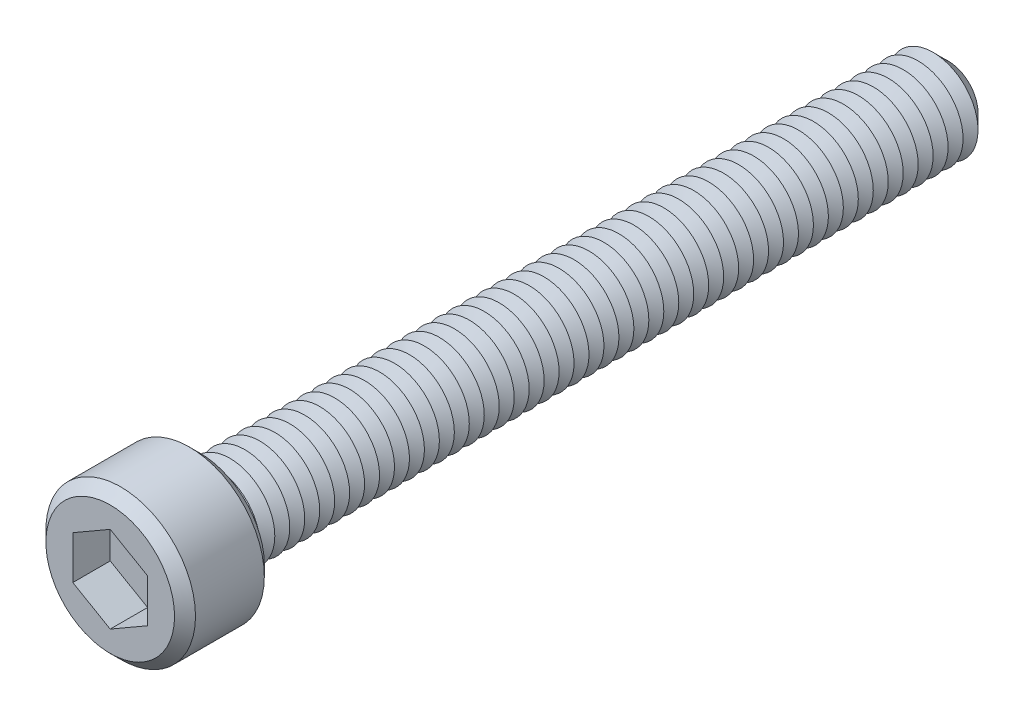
ISO-10303-21;
HEADER;
FILE_DESCRIPTION(('STEP AP214'),'2;1');
FILE_NAME('part.step','',(''),(''),'','','');
FILE_SCHEMA(('AUTOMOTIVE_DESIGN { 1 0 10303 214 1 1 1 1 }'));
ENDSEC;
DATA;
#1=APPLICATION_CONTEXT('core data for automotive mechanical design processes');
#2=APPLICATION_PROTOCOL_DEFINITION('international standard','automotive_design',2000,#1);
#3=PRODUCT_CONTEXT('',#1,'mechanical');
#4=PRODUCT('Part','Part','',(#3));
#5=PRODUCT_RELATED_PRODUCT_CATEGORY('part','',(#4));
#6=PRODUCT_DEFINITION_FORMATION('','',#4);
#7=PRODUCT_DEFINITION_CONTEXT('part definition',#1,'design');
#8=PRODUCT_DEFINITION('design','',#6,#7);
#9=PRODUCT_DEFINITION_SHAPE('','',#8);
#10=(LENGTH_UNIT() NAMED_UNIT(*) SI_UNIT(.MILLI.,.METRE.));
#11=(NAMED_UNIT(*) PLANE_ANGLE_UNIT() SI_UNIT($,.RADIAN.));
#12=(NAMED_UNIT(*) SI_UNIT($,.STERADIAN.) SOLID_ANGLE_UNIT());
#13=UNCERTAINTY_MEASURE_WITH_UNIT(LENGTH_MEASURE(1.E-05),#10,'distance_accuracy_value','');
#14=(GEOMETRIC_REPRESENTATION_CONTEXT(3) GLOBAL_UNCERTAINTY_ASSIGNED_CONTEXT((#13)) GLOBAL_UNIT_ASSIGNED_CONTEXT((#10,
#11,#12)) REPRESENTATION_CONTEXT('',''));
#15=CARTESIAN_POINT('',(0.,0.,0.));
#16=DIRECTION('',(0.,0.,1.));
#17=DIRECTION('',(1.,0.,0.));
#18=AXIS2_PLACEMENT_3D('',#15,#16,#17);
#19=CARTESIAN_POINT('',(0.,0.,6.));
#20=DIRECTION('',(0.,0.,-1.));
#21=DIRECTION('',(-1.,0.,0.));
#22=AXIS2_PLACEMENT_3D('',#19,#20,#21);
#23=CYLINDRICAL_SURFACE('',#22,5.);
#24=CARTESIAN_POINT('',(0.,0.,0.699999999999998));
#25=DIRECTION('',(0.,0.,1.));
#26=DIRECTION('',(1.,0.,0.));
#27=AXIS2_PLACEMENT_3D('',#24,#25,#26);
#28=CIRCLE('',#27,5.);
#29=CARTESIAN_POINT('',(5.,0.,0.699999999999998));
#30=VERTEX_POINT('',#29);
#31=EDGE_CURVE('E569',#30,#30,#28,.T.);
#32=ORIENTED_EDGE('',*,*,#31,.T.);
#33=EDGE_LOOP('',(#32));
#34=FACE_BOUND('',#33,.T.);
#35=CARTESIAN_POINT('',(0.,0.,5.30000000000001));
#36=DIRECTION('',(0.,0.,1.));
#37=DIRECTION('',(1.,0.,0.));
#38=AXIS2_PLACEMENT_3D('',#35,#36,#37);
#39=CIRCLE('',#38,5.);
#40=CARTESIAN_POINT('',(5.,0.,5.30000000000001));
#41=VERTEX_POINT('',#40);
#42=EDGE_CURVE('E565',#41,#41,#39,.F.);
#43=ORIENTED_EDGE('',*,*,#42,.T.);
#44=EDGE_LOOP('',(#43));
#45=FACE_BOUND('',#44,.T.);
#46=ADVANCED_FACE('F39',(#34,#45),#23,.T.);
#47=CARTESIAN_POINT('',(0.,0.,6.));
#48=DIRECTION('',(0.,0.,1.));
#49=DIRECTION('',(1.,0.,0.));
#50=AXIS2_PLACEMENT_3D('',#47,#48,#49);
#51=PLANE('',#50);
#52=CARTESIAN_POINT('',(0.,0.,6.));
#53=DIRECTION('',(0.,0.,1.));
#54=DIRECTION('',(1.,0.,0.));
#55=AXIS2_PLACEMENT_3D('',#52,#53,#54);
#56=CIRCLE('',#55,4.30000000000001);
#57=CARTESIAN_POINT('',(4.30000000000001,0.,6.));
#58=VERTEX_POINT('',#57);
#59=EDGE_CURVE('E11',#58,#58,#56,.T.);
#60=ORIENTED_EDGE('',*,*,#59,.T.);
#61=EDGE_LOOP('',(#60));
#62=FACE_BOUND('',#61,.T.);
#63=DIRECTION('',(-0.866025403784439,0.5,0.));
#64=VECTOR('',#63,1.);
#65=CARTESIAN_POINT('',(2.5,1.44337567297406,6.));
#66=LINE('',#65,#64);
#67=CARTESIAN_POINT('',(2.5,1.44337567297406,6.));
#68=VERTEX_POINT('',#67);
#69=CARTESIAN_POINT('',(0.,2.88675134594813,6.));
#70=VERTEX_POINT('',#69);
#71=EDGE_CURVE('E55',#68,#70,#66,.T.);
#72=ORIENTED_EDGE('',*,*,#71,.F.);
#73=DIRECTION('',(0.,1.,0.));
#74=VECTOR('',#73,1.);
#75=CARTESIAN_POINT('',(2.5,-1.44337567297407,6.));
#76=LINE('',#75,#74);
#77=CARTESIAN_POINT('',(2.5,-1.44337567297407,6.));
#78=VERTEX_POINT('',#77);
#79=EDGE_CURVE('E151',#78,#68,#76,.T.);
#80=ORIENTED_EDGE('',*,*,#79,.F.);
#81=DIRECTION('',(0.866025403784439,0.5,0.));
#82=VECTOR('',#81,1.);
#83=CARTESIAN_POINT('',(0.,-2.88675134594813,6.));
#84=LINE('',#83,#82);
#85=CARTESIAN_POINT('',(0.,-2.88675134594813,6.));
#86=VERTEX_POINT('',#85);
#87=EDGE_CURVE('E148',#86,#78,#84,.T.);
#88=ORIENTED_EDGE('',*,*,#87,.F.);
#89=DIRECTION('',(0.866025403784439,-0.5,0.));
#90=VECTOR('',#89,1.);
#91=CARTESIAN_POINT('',(-2.5,-1.44337567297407,6.));
#92=LINE('',#91,#90);
#93=CARTESIAN_POINT('',(-2.5,-1.44337567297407,6.));
#94=VERTEX_POINT('',#93);
#95=EDGE_CURVE('E103',#94,#86,#92,.T.);
#96=ORIENTED_EDGE('',*,*,#95,.F.);
#97=DIRECTION('',(0.,-1.,0.));
#98=VECTOR('',#97,1.);
#99=CARTESIAN_POINT('',(-2.5,1.44337567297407,6.));
#100=LINE('',#99,#98);
#101=CARTESIAN_POINT('',(-2.5,1.44337567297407,6.));
#102=VERTEX_POINT('',#101);
#103=EDGE_CURVE('E142',#102,#94,#100,.T.);
#104=ORIENTED_EDGE('',*,*,#103,.F.);
#105=DIRECTION('',(-0.866025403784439,-0.5,0.));
#106=VECTOR('',#105,1.);
#107=CARTESIAN_POINT('',(0.,2.88675134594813,6.));
#108=LINE('',#107,#106);
#109=EDGE_CURVE('E137',#70,#102,#108,.T.);
#110=ORIENTED_EDGE('',*,*,#109,.F.);
#111=EDGE_LOOP('',(#72,#80,#88,#96,#104,#110));
#112=FACE_BOUND('',#111,.T.);
#113=ADVANCED_FACE('F587',(#62,#112),#51,.T.);
#114=CARTESIAN_POINT('',(0.,0.,0.));
#115=DIRECTION('',(0.,0.,1.));
#116=DIRECTION('',(1.,0.,0.));
#117=AXIS2_PLACEMENT_3D('',#114,#115,#116);
#118=PLANE('',#117);
#119=CARTESIAN_POINT('',(0.,0.,0.));
#120=DIRECTION('',(0.,0.,1.));
#121=DIRECTION('',(1.,0.,0.));
#122=AXIS2_PLACEMENT_3D('',#119,#120,#121);
#123=CIRCLE('',#122,4.29999999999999);
#124=CARTESIAN_POINT('',(4.29999999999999,0.,0.));
#125=VERTEX_POINT('',#124);
#126=EDGE_CURVE('E48',#125,#125,#123,.F.);
#127=ORIENTED_EDGE('',*,*,#126,.T.);
#128=EDGE_LOOP('',(#127));
#129=FACE_BOUND('',#128,.T.);
#130=CARTESIAN_POINT('',(0.,0.,0.));
#131=DIRECTION('',(0.,0.,1.));
#132=DIRECTION('',(1.,0.,0.));
#133=AXIS2_PLACEMENT_3D('',#130,#131,#132);
#134=CIRCLE('',#133,3.);
#135=CARTESIAN_POINT('',(3.,0.,0.));
#136=VERTEX_POINT('',#135);
#137=EDGE_CURVE('E557',#136,#136,#134,.T.);
#138=ORIENTED_EDGE('',*,*,#137,.T.);
#139=EDGE_LOOP('',(#138));
#140=FACE_BOUND('',#139,.T.);
#141=ADVANCED_FACE('F576',(#129,#140),#118,.F.);
#142=CARTESIAN_POINT('',(0.,0.,0.));
#143=DIRECTION('',(0.,0.,1.));
#144=DIRECTION('',(1.,0.,0.));
#145=AXIS2_PLACEMENT_3D('',#142,#143,#144);
#146=CONICAL_SURFACE('',#145,3.,1.0471975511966);
#147=CARTESIAN_POINT('',(0.,0.,-0.500000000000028));
#148=DIRECTION('',(0.,0.,1.));
#149=DIRECTION('',(1.,0.,0.));
#150=AXIS2_PLACEMENT_3D('',#147,#148,#149);
#151=CIRCLE('',#150,2.13397459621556);
#152=CARTESIAN_POINT('',(2.13397459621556,0.,-0.500000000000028));
#153=VERTEX_POINT('',#152);
#154=EDGE_CURVE('E553',#153,#153,#151,.T.);
#155=ORIENTED_EDGE('',*,*,#154,.T.);
#156=EDGE_LOOP('',(#155));
#157=FACE_BOUND('',#156,.T.);
#158=ORIENTED_EDGE('',*,*,#137,.F.);
#159=EDGE_LOOP('',(#158));
#160=FACE_BOUND('',#159,.T.);
#161=ADVANCED_FACE('F1028',(#157,#160),#146,.T.);
#162=CARTESIAN_POINT('',(0.,0.,-0.500000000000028));
#163=DIRECTION('',(0.,0.,-1.));
#164=DIRECTION('',(-1.,0.,0.));
#165=AXIS2_PLACEMENT_3D('',#162,#163,#164);
#166=CONICAL_SURFACE('',#165,2.13397459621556,1.0471975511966);
#167=CARTESIAN_POINT('',(0.,0.,-1.00000000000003));
#168=DIRECTION('',(0.,0.,1.));
#169=DIRECTION('',(1.,0.,0.));
#170=AXIS2_PLACEMENT_3D('',#167,#168,#169);
#171=CIRCLE('',#170,3.);
#172=CARTESIAN_POINT('',(3.,0.,-1.00000000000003));
#173=VERTEX_POINT('',#172);
#174=EDGE_CURVE('E549',#173,#173,#171,.T.);
#175=ORIENTED_EDGE('',*,*,#174,.T.);
#176=EDGE_LOOP('',(#175));
#177=FACE_BOUND('',#176,.T.);
#178=ORIENTED_EDGE('',*,*,#154,.F.);
#179=EDGE_LOOP('',(#178));
#180=FACE_BOUND('',#179,.T.);
#181=ADVANCED_FACE('F1024',(#177,#180),#166,.T.);
#182=CARTESIAN_POINT('',(0.,0.,-1.00000000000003));
#183=DIRECTION('',(0.,0.,1.));
#184=DIRECTION('',(1.,0.,0.));
#185=AXIS2_PLACEMENT_3D('',#182,#183,#184);
#186=CONICAL_SURFACE('',#185,3.,1.0471975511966);
#187=CARTESIAN_POINT('',(0.,0.,-1.50000000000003));
#188=DIRECTION('',(0.,0.,1.));
#189=DIRECTION('',(1.,0.,0.));
#190=AXIS2_PLACEMENT_3D('',#187,#188,#189);
#191=CIRCLE('',#190,2.13397459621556);
#192=CARTESIAN_POINT('',(2.13397459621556,0.,-1.50000000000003));
#193=VERTEX_POINT('',#192);
#194=EDGE_CURVE('E545',#193,#193,#191,.T.);
#195=ORIENTED_EDGE('',*,*,#194,.T.);
#196=EDGE_LOOP('',(#195));
#197=FACE_BOUND('',#196,.T.);
#198=ORIENTED_EDGE('',*,*,#174,.F.);
#199=EDGE_LOOP('',(#198));
#200=FACE_BOUND('',#199,.T.);
#201=ADVANCED_FACE('F1020',(#197,#200),#186,.T.);
#202=CARTESIAN_POINT('',(0.,0.,-1.50000000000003));
#203=DIRECTION('',(0.,0.,-1.));
#204=DIRECTION('',(-1.,0.,0.));
#205=AXIS2_PLACEMENT_3D('',#202,#203,#204);
#206=CONICAL_SURFACE('',#205,2.13397459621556,1.0471975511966);
#207=CARTESIAN_POINT('',(0.,0.,-2.00000000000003));
#208=DIRECTION('',(0.,0.,1.));
#209=DIRECTION('',(1.,0.,0.));
#210=AXIS2_PLACEMENT_3D('',#207,#208,#209);
#211=CIRCLE('',#210,3.);
#212=CARTESIAN_POINT('',(3.,0.,-2.00000000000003));
#213=VERTEX_POINT('',#212);
#214=EDGE_CURVE('E541',#213,#213,#211,.T.);
#215=ORIENTED_EDGE('',*,*,#214,.T.);
#216=EDGE_LOOP('',(#215));
#217=FACE_BOUND('',#216,.T.);
#218=ORIENTED_EDGE('',*,*,#194,.F.);
#219=EDGE_LOOP('',(#218));
#220=FACE_BOUND('',#219,.T.);
#221=ADVANCED_FACE('F1016',(#217,#220),#206,.T.);
#222=CARTESIAN_POINT('',(0.,0.,-2.00000000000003));
#223=DIRECTION('',(0.,0.,1.));
#224=DIRECTION('',(1.,0.,0.));
#225=AXIS2_PLACEMENT_3D('',#222,#223,#224);
#226=CONICAL_SURFACE('',#225,3.,1.0471975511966);
#227=CARTESIAN_POINT('',(0.,0.,-2.50000000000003));
#228=DIRECTION('',(0.,0.,1.));
#229=DIRECTION('',(1.,0.,0.));
#230=AXIS2_PLACEMENT_3D('',#227,#228,#229);
#231=CIRCLE('',#230,2.13397459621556);
#232=CARTESIAN_POINT('',(2.13397459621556,0.,-2.50000000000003));
#233=VERTEX_POINT('',#232);
#234=EDGE_CURVE('E537',#233,#233,#231,.T.);
#235=ORIENTED_EDGE('',*,*,#234,.T.);
#236=EDGE_LOOP('',(#235));
#237=FACE_BOUND('',#236,.T.);
#238=ORIENTED_EDGE('',*,*,#214,.F.);
#239=EDGE_LOOP('',(#238));
#240=FACE_BOUND('',#239,.T.);
#241=ADVANCED_FACE('F1012',(#237,#240),#226,.T.);
#242=CARTESIAN_POINT('',(0.,0.,-2.50000000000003));
#243=DIRECTION('',(0.,0.,-1.));
#244=DIRECTION('',(-1.,0.,0.));
#245=AXIS2_PLACEMENT_3D('',#242,#243,#244);
#246=CONICAL_SURFACE('',#245,2.13397459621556,1.0471975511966);
#247=CARTESIAN_POINT('',(0.,0.,-3.00000000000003));
#248=DIRECTION('',(0.,0.,1.));
#249=DIRECTION('',(1.,0.,0.));
#250=AXIS2_PLACEMENT_3D('',#247,#248,#249);
#251=CIRCLE('',#250,3.);
#252=CARTESIAN_POINT('',(3.,0.,-3.00000000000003));
#253=VERTEX_POINT('',#252);
#254=EDGE_CURVE('E533',#253,#253,#251,.T.);
#255=ORIENTED_EDGE('',*,*,#254,.T.);
#256=EDGE_LOOP('',(#255));
#257=FACE_BOUND('',#256,.T.);
#258=ORIENTED_EDGE('',*,*,#234,.F.);
#259=EDGE_LOOP('',(#258));
#260=FACE_BOUND('',#259,.T.);
#261=ADVANCED_FACE('F1008',(#257,#260),#246,.T.);
#262=CARTESIAN_POINT('',(0.,0.,-3.00000000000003));
#263=DIRECTION('',(0.,0.,1.));
#264=DIRECTION('',(1.,0.,0.));
#265=AXIS2_PLACEMENT_3D('',#262,#263,#264);
#266=CONICAL_SURFACE('',#265,3.,1.0471975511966);
#267=CARTESIAN_POINT('',(0.,0.,-3.50000000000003));
#268=DIRECTION('',(0.,0.,1.));
#269=DIRECTION('',(1.,0.,0.));
#270=AXIS2_PLACEMENT_3D('',#267,#268,#269);
#271=CIRCLE('',#270,2.13397459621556);
#272=CARTESIAN_POINT('',(2.13397459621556,0.,-3.50000000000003));
#273=VERTEX_POINT('',#272);
#274=EDGE_CURVE('E529',#273,#273,#271,.T.);
#275=ORIENTED_EDGE('',*,*,#274,.T.);
#276=EDGE_LOOP('',(#275));
#277=FACE_BOUND('',#276,.T.);
#278=ORIENTED_EDGE('',*,*,#254,.F.);
#279=EDGE_LOOP('',(#278));
#280=FACE_BOUND('',#279,.T.);
#281=ADVANCED_FACE('F1004',(#277,#280),#266,.T.);
#282=CARTESIAN_POINT('',(0.,0.,-3.50000000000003));
#283=DIRECTION('',(0.,0.,-1.));
#284=DIRECTION('',(-1.,0.,0.));
#285=AXIS2_PLACEMENT_3D('',#282,#283,#284);
#286=CONICAL_SURFACE('',#285,2.13397459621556,1.0471975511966);
#287=CARTESIAN_POINT('',(0.,0.,-4.00000000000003));
#288=DIRECTION('',(0.,0.,1.));
#289=DIRECTION('',(1.,0.,0.));
#290=AXIS2_PLACEMENT_3D('',#287,#288,#289);
#291=CIRCLE('',#290,3.);
#292=CARTESIAN_POINT('',(3.,0.,-4.00000000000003));
#293=VERTEX_POINT('',#292);
#294=EDGE_CURVE('E525',#293,#293,#291,.T.);
#295=ORIENTED_EDGE('',*,*,#294,.T.);
#296=EDGE_LOOP('',(#295));
#297=FACE_BOUND('',#296,.T.);
#298=ORIENTED_EDGE('',*,*,#274,.F.);
#299=EDGE_LOOP('',(#298));
#300=FACE_BOUND('',#299,.T.);
#301=ADVANCED_FACE('F1000',(#297,#300),#286,.T.);
#302=CARTESIAN_POINT('',(0.,0.,-4.00000000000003));
#303=DIRECTION('',(0.,0.,1.));
#304=DIRECTION('',(1.,0.,0.));
#305=AXIS2_PLACEMENT_3D('',#302,#303,#304);
#306=CONICAL_SURFACE('',#305,3.,1.0471975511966);
#307=CARTESIAN_POINT('',(0.,0.,-4.50000000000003));
#308=DIRECTION('',(0.,0.,1.));
#309=DIRECTION('',(1.,0.,0.));
#310=AXIS2_PLACEMENT_3D('',#307,#308,#309);
#311=CIRCLE('',#310,2.13397459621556);
#312=CARTESIAN_POINT('',(2.13397459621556,0.,-4.50000000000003));
#313=VERTEX_POINT('',#312);
#314=EDGE_CURVE('E521',#313,#313,#311,.T.);
#315=ORIENTED_EDGE('',*,*,#314,.T.);
#316=EDGE_LOOP('',(#315));
#317=FACE_BOUND('',#316,.T.);
#318=ORIENTED_EDGE('',*,*,#294,.F.);
#319=EDGE_LOOP('',(#318));
#320=FACE_BOUND('',#319,.T.);
#321=ADVANCED_FACE('F996',(#317,#320),#306,.T.);
#322=CARTESIAN_POINT('',(0.,0.,-4.50000000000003));
#323=DIRECTION('',(0.,0.,-1.));
#324=DIRECTION('',(-1.,0.,0.));
#325=AXIS2_PLACEMENT_3D('',#322,#323,#324);
#326=CONICAL_SURFACE('',#325,2.13397459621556,1.0471975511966);
#327=CARTESIAN_POINT('',(0.,0.,-5.00000000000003));
#328=DIRECTION('',(0.,0.,1.));
#329=DIRECTION('',(1.,0.,0.));
#330=AXIS2_PLACEMENT_3D('',#327,#328,#329);
#331=CIRCLE('',#330,3.);
#332=CARTESIAN_POINT('',(3.,0.,-5.00000000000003));
#333=VERTEX_POINT('',#332);
#334=EDGE_CURVE('E517',#333,#333,#331,.T.);
#335=ORIENTED_EDGE('',*,*,#334,.T.);
#336=EDGE_LOOP('',(#335));
#337=FACE_BOUND('',#336,.T.);
#338=ORIENTED_EDGE('',*,*,#314,.F.);
#339=EDGE_LOOP('',(#338));
#340=FACE_BOUND('',#339,.T.);
#341=ADVANCED_FACE('F992',(#337,#340),#326,.T.);
#342=CARTESIAN_POINT('',(0.,0.,-5.00000000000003));
#343=DIRECTION('',(0.,0.,1.));
#344=DIRECTION('',(1.,0.,0.));
#345=AXIS2_PLACEMENT_3D('',#342,#343,#344);
#346=CONICAL_SURFACE('',#345,3.,1.0471975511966);
#347=CARTESIAN_POINT('',(0.,0.,-5.50000000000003));
#348=DIRECTION('',(0.,0.,1.));
#349=DIRECTION('',(1.,0.,0.));
#350=AXIS2_PLACEMENT_3D('',#347,#348,#349);
#351=CIRCLE('',#350,2.13397459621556);
#352=CARTESIAN_POINT('',(2.13397459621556,0.,-5.50000000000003));
#353=VERTEX_POINT('',#352);
#354=EDGE_CURVE('E513',#353,#353,#351,.T.);
#355=ORIENTED_EDGE('',*,*,#354,.T.);
#356=EDGE_LOOP('',(#355));
#357=FACE_BOUND('',#356,.T.);
#358=ORIENTED_EDGE('',*,*,#334,.F.);
#359=EDGE_LOOP('',(#358));
#360=FACE_BOUND('',#359,.T.);
#361=ADVANCED_FACE('F988',(#357,#360),#346,.T.);
#362=CARTESIAN_POINT('',(0.,0.,-5.50000000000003));
#363=DIRECTION('',(0.,0.,-1.));
#364=DIRECTION('',(-1.,0.,0.));
#365=AXIS2_PLACEMENT_3D('',#362,#363,#364);
#366=CONICAL_SURFACE('',#365,2.13397459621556,1.0471975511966);
#367=CARTESIAN_POINT('',(0.,0.,-6.00000000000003));
#368=DIRECTION('',(0.,0.,1.));
#369=DIRECTION('',(1.,0.,0.));
#370=AXIS2_PLACEMENT_3D('',#367,#368,#369);
#371=CIRCLE('',#370,3.);
#372=CARTESIAN_POINT('',(3.,0.,-6.00000000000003));
#373=VERTEX_POINT('',#372);
#374=EDGE_CURVE('E509',#373,#373,#371,.T.);
#375=ORIENTED_EDGE('',*,*,#374,.T.);
#376=EDGE_LOOP('',(#375));
#377=FACE_BOUND('',#376,.T.);
#378=ORIENTED_EDGE('',*,*,#354,.F.);
#379=EDGE_LOOP('',(#378));
#380=FACE_BOUND('',#379,.T.);
#381=ADVANCED_FACE('F984',(#377,#380),#366,.T.);
#382=CARTESIAN_POINT('',(0.,0.,-6.00000000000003));
#383=DIRECTION('',(0.,0.,1.));
#384=DIRECTION('',(1.,0.,0.));
#385=AXIS2_PLACEMENT_3D('',#382,#383,#384);
#386=CONICAL_SURFACE('',#385,3.,1.0471975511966);
#387=CARTESIAN_POINT('',(0.,0.,-6.50000000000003));
#388=DIRECTION('',(0.,0.,1.));
#389=DIRECTION('',(1.,0.,0.));
#390=AXIS2_PLACEMENT_3D('',#387,#388,#389);
#391=CIRCLE('',#390,2.13397459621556);
#392=CARTESIAN_POINT('',(2.13397459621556,0.,-6.50000000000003));
#393=VERTEX_POINT('',#392);
#394=EDGE_CURVE('E505',#393,#393,#391,.T.);
#395=ORIENTED_EDGE('',*,*,#394,.T.);
#396=EDGE_LOOP('',(#395));
#397=FACE_BOUND('',#396,.T.);
#398=ORIENTED_EDGE('',*,*,#374,.F.);
#399=EDGE_LOOP('',(#398));
#400=FACE_BOUND('',#399,.T.);
#401=ADVANCED_FACE('F980',(#397,#400),#386,.T.);
#402=CARTESIAN_POINT('',(0.,0.,-6.50000000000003));
#403=DIRECTION('',(0.,0.,-1.));
#404=DIRECTION('',(-1.,0.,0.));
#405=AXIS2_PLACEMENT_3D('',#402,#403,#404);
#406=CONICAL_SURFACE('',#405,2.13397459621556,1.0471975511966);
#407=CARTESIAN_POINT('',(0.,0.,-7.00000000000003));
#408=DIRECTION('',(0.,0.,1.));
#409=DIRECTION('',(1.,0.,0.));
#410=AXIS2_PLACEMENT_3D('',#407,#408,#409);
#411=CIRCLE('',#410,3.);
#412=CARTESIAN_POINT('',(3.,0.,-7.00000000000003));
#413=VERTEX_POINT('',#412);
#414=EDGE_CURVE('E501',#413,#413,#411,.T.);
#415=ORIENTED_EDGE('',*,*,#414,.T.);
#416=EDGE_LOOP('',(#415));
#417=FACE_BOUND('',#416,.T.);
#418=ORIENTED_EDGE('',*,*,#394,.F.);
#419=EDGE_LOOP('',(#418));
#420=FACE_BOUND('',#419,.T.);
#421=ADVANCED_FACE('F976',(#417,#420),#406,.T.);
#422=CARTESIAN_POINT('',(0.,0.,-7.00000000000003));
#423=DIRECTION('',(0.,0.,1.));
#424=DIRECTION('',(1.,0.,0.));
#425=AXIS2_PLACEMENT_3D('',#422,#423,#424);
#426=CONICAL_SURFACE('',#425,3.,1.0471975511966);
#427=CARTESIAN_POINT('',(0.,0.,-7.50000000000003));
#428=DIRECTION('',(0.,0.,1.));
#429=DIRECTION('',(1.,0.,0.));
#430=AXIS2_PLACEMENT_3D('',#427,#428,#429);
#431=CIRCLE('',#430,2.13397459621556);
#432=CARTESIAN_POINT('',(2.13397459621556,0.,-7.50000000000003));
#433=VERTEX_POINT('',#432);
#434=EDGE_CURVE('E497',#433,#433,#431,.T.);
#435=ORIENTED_EDGE('',*,*,#434,.T.);
#436=EDGE_LOOP('',(#435));
#437=FACE_BOUND('',#436,.T.);
#438=ORIENTED_EDGE('',*,*,#414,.F.);
#439=EDGE_LOOP('',(#438));
#440=FACE_BOUND('',#439,.T.);
#441=ADVANCED_FACE('F972',(#437,#440),#426,.T.);
#442=CARTESIAN_POINT('',(0.,0.,-7.50000000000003));
#443=DIRECTION('',(0.,0.,-1.));
#444=DIRECTION('',(-1.,0.,0.));
#445=AXIS2_PLACEMENT_3D('',#442,#443,#444);
#446=CONICAL_SURFACE('',#445,2.13397459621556,1.0471975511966);
#447=CARTESIAN_POINT('',(0.,0.,-8.00000000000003));
#448=DIRECTION('',(0.,0.,1.));
#449=DIRECTION('',(1.,0.,0.));
#450=AXIS2_PLACEMENT_3D('',#447,#448,#449);
#451=CIRCLE('',#450,3.);
#452=CARTESIAN_POINT('',(3.,0.,-8.00000000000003));
#453=VERTEX_POINT('',#452);
#454=EDGE_CURVE('E493',#453,#453,#451,.T.);
#455=ORIENTED_EDGE('',*,*,#454,.T.);
#456=EDGE_LOOP('',(#455));
#457=FACE_BOUND('',#456,.T.);
#458=ORIENTED_EDGE('',*,*,#434,.F.);
#459=EDGE_LOOP('',(#458));
#460=FACE_BOUND('',#459,.T.);
#461=ADVANCED_FACE('F968',(#457,#460),#446,.T.);
#462=CARTESIAN_POINT('',(0.,0.,-8.00000000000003));
#463=DIRECTION('',(0.,0.,1.));
#464=DIRECTION('',(1.,0.,0.));
#465=AXIS2_PLACEMENT_3D('',#462,#463,#464);
#466=CONICAL_SURFACE('',#465,3.,1.0471975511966);
#467=CARTESIAN_POINT('',(0.,0.,-8.50000000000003));
#468=DIRECTION('',(0.,0.,1.));
#469=DIRECTION('',(1.,0.,0.));
#470=AXIS2_PLACEMENT_3D('',#467,#468,#469);
#471=CIRCLE('',#470,2.13397459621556);
#472=CARTESIAN_POINT('',(2.13397459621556,0.,-8.50000000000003));
#473=VERTEX_POINT('',#472);
#474=EDGE_CURVE('E489',#473,#473,#471,.T.);
#475=ORIENTED_EDGE('',*,*,#474,.T.);
#476=EDGE_LOOP('',(#475));
#477=FACE_BOUND('',#476,.T.);
#478=ORIENTED_EDGE('',*,*,#454,.F.);
#479=EDGE_LOOP('',(#478));
#480=FACE_BOUND('',#479,.T.);
#481=ADVANCED_FACE('F964',(#477,#480),#466,.T.);
#482=CARTESIAN_POINT('',(0.,0.,-8.50000000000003));
#483=DIRECTION('',(0.,0.,-1.));
#484=DIRECTION('',(-1.,0.,0.));
#485=AXIS2_PLACEMENT_3D('',#482,#483,#484);
#486=CONICAL_SURFACE('',#485,2.13397459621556,1.0471975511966);
#487=CARTESIAN_POINT('',(0.,0.,-9.00000000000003));
#488=DIRECTION('',(0.,0.,1.));
#489=DIRECTION('',(1.,0.,0.));
#490=AXIS2_PLACEMENT_3D('',#487,#488,#489);
#491=CIRCLE('',#490,3.);
#492=CARTESIAN_POINT('',(3.,0.,-9.00000000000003));
#493=VERTEX_POINT('',#492);
#494=EDGE_CURVE('E485',#493,#493,#491,.T.);
#495=ORIENTED_EDGE('',*,*,#494,.T.);
#496=EDGE_LOOP('',(#495));
#497=FACE_BOUND('',#496,.T.);
#498=ORIENTED_EDGE('',*,*,#474,.F.);
#499=EDGE_LOOP('',(#498));
#500=FACE_BOUND('',#499,.T.);
#501=ADVANCED_FACE('F960',(#497,#500),#486,.T.);
#502=CARTESIAN_POINT('',(0.,0.,-9.00000000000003));
#503=DIRECTION('',(0.,0.,1.));
#504=DIRECTION('',(1.,0.,0.));
#505=AXIS2_PLACEMENT_3D('',#502,#503,#504);
#506=CONICAL_SURFACE('',#505,3.,1.0471975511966);
#507=CARTESIAN_POINT('',(0.,0.,-9.50000000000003));
#508=DIRECTION('',(0.,0.,1.));
#509=DIRECTION('',(1.,0.,0.));
#510=AXIS2_PLACEMENT_3D('',#507,#508,#509);
#511=CIRCLE('',#510,2.13397459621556);
#512=CARTESIAN_POINT('',(2.13397459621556,0.,-9.50000000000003));
#513=VERTEX_POINT('',#512);
#514=EDGE_CURVE('E481',#513,#513,#511,.T.);
#515=ORIENTED_EDGE('',*,*,#514,.T.);
#516=EDGE_LOOP('',(#515));
#517=FACE_BOUND('',#516,.T.);
#518=ORIENTED_EDGE('',*,*,#494,.F.);
#519=EDGE_LOOP('',(#518));
#520=FACE_BOUND('',#519,.T.);
#521=ADVANCED_FACE('F956',(#517,#520),#506,.T.);
#522=CARTESIAN_POINT('',(0.,0.,-9.50000000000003));
#523=DIRECTION('',(0.,0.,-1.));
#524=DIRECTION('',(-1.,0.,0.));
#525=AXIS2_PLACEMENT_3D('',#522,#523,#524);
#526=CONICAL_SURFACE('',#525,2.13397459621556,1.0471975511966);
#527=CARTESIAN_POINT('',(0.,0.,-10.));
#528=DIRECTION('',(0.,0.,1.));
#529=DIRECTION('',(1.,0.,0.));
#530=AXIS2_PLACEMENT_3D('',#527,#528,#529);
#531=CIRCLE('',#530,3.);
#532=CARTESIAN_POINT('',(3.,0.,-10.));
#533=VERTEX_POINT('',#532);
#534=EDGE_CURVE('E477',#533,#533,#531,.T.);
#535=ORIENTED_EDGE('',*,*,#534,.T.);
#536=EDGE_LOOP('',(#535));
#537=FACE_BOUND('',#536,.T.);
#538=ORIENTED_EDGE('',*,*,#514,.F.);
#539=EDGE_LOOP('',(#538));
#540=FACE_BOUND('',#539,.T.);
#541=ADVANCED_FACE('F952',(#537,#540),#526,.T.);
#542=CARTESIAN_POINT('',(0.,0.,-10.));
#543=DIRECTION('',(0.,0.,1.));
#544=DIRECTION('',(1.,0.,0.));
#545=AXIS2_PLACEMENT_3D('',#542,#543,#544);
#546=CONICAL_SURFACE('',#545,3.,1.0471975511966);
#547=CARTESIAN_POINT('',(0.,0.,-10.5));
#548=DIRECTION('',(0.,0.,1.));
#549=DIRECTION('',(1.,0.,0.));
#550=AXIS2_PLACEMENT_3D('',#547,#548,#549);
#551=CIRCLE('',#550,2.13397459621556);
#552=CARTESIAN_POINT('',(2.13397459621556,0.,-10.5));
#553=VERTEX_POINT('',#552);
#554=EDGE_CURVE('E473',#553,#553,#551,.T.);
#555=ORIENTED_EDGE('',*,*,#554,.T.);
#556=EDGE_LOOP('',(#555));
#557=FACE_BOUND('',#556,.T.);
#558=ORIENTED_EDGE('',*,*,#534,.F.);
#559=EDGE_LOOP('',(#558));
#560=FACE_BOUND('',#559,.T.);
#561=ADVANCED_FACE('F948',(#557,#560),#546,.T.);
#562=CARTESIAN_POINT('',(0.,0.,-10.5));
#563=DIRECTION('',(0.,0.,-1.));
#564=DIRECTION('',(-1.,0.,0.));
#565=AXIS2_PLACEMENT_3D('',#562,#563,#564);
#566=CONICAL_SURFACE('',#565,2.13397459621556,1.0471975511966);
#567=CARTESIAN_POINT('',(0.,0.,-11.));
#568=DIRECTION('',(0.,0.,1.));
#569=DIRECTION('',(1.,0.,0.));
#570=AXIS2_PLACEMENT_3D('',#567,#568,#569);
#571=CIRCLE('',#570,3.);
#572=CARTESIAN_POINT('',(3.,0.,-11.));
#573=VERTEX_POINT('',#572);
#574=EDGE_CURVE('E469',#573,#573,#571,.T.);
#575=ORIENTED_EDGE('',*,*,#574,.T.);
#576=EDGE_LOOP('',(#575));
#577=FACE_BOUND('',#576,.T.);
#578=ORIENTED_EDGE('',*,*,#554,.F.);
#579=EDGE_LOOP('',(#578));
#580=FACE_BOUND('',#579,.T.);
#581=ADVANCED_FACE('F944',(#577,#580),#566,.T.);
#582=CARTESIAN_POINT('',(0.,0.,-11.));
#583=DIRECTION('',(0.,0.,1.));
#584=DIRECTION('',(1.,0.,0.));
#585=AXIS2_PLACEMENT_3D('',#582,#583,#584);
#586=CONICAL_SURFACE('',#585,3.,1.0471975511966);
#587=CARTESIAN_POINT('',(0.,0.,-11.5));
#588=DIRECTION('',(0.,0.,1.));
#589=DIRECTION('',(1.,0.,0.));
#590=AXIS2_PLACEMENT_3D('',#587,#588,#589);
#591=CIRCLE('',#590,2.13397459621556);
#592=CARTESIAN_POINT('',(2.13397459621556,0.,-11.5));
#593=VERTEX_POINT('',#592);
#594=EDGE_CURVE('E465',#593,#593,#591,.T.);
#595=ORIENTED_EDGE('',*,*,#594,.T.);
#596=EDGE_LOOP('',(#595));
#597=FACE_BOUND('',#596,.T.);
#598=ORIENTED_EDGE('',*,*,#574,.F.);
#599=EDGE_LOOP('',(#598));
#600=FACE_BOUND('',#599,.T.);
#601=ADVANCED_FACE('F940',(#597,#600),#586,.T.);
#602=CARTESIAN_POINT('',(0.,0.,-11.5));
#603=DIRECTION('',(0.,0.,-1.));
#604=DIRECTION('',(-1.,0.,0.));
#605=AXIS2_PLACEMENT_3D('',#602,#603,#604);
#606=CONICAL_SURFACE('',#605,2.13397459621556,1.0471975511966);
#607=CARTESIAN_POINT('',(0.,0.,-12.));
#608=DIRECTION('',(0.,0.,1.));
#609=DIRECTION('',(1.,0.,0.));
#610=AXIS2_PLACEMENT_3D('',#607,#608,#609);
#611=CIRCLE('',#610,3.);
#612=CARTESIAN_POINT('',(3.,0.,-12.));
#613=VERTEX_POINT('',#612);
#614=EDGE_CURVE('E461',#613,#613,#611,.T.);
#615=ORIENTED_EDGE('',*,*,#614,.T.);
#616=EDGE_LOOP('',(#615));
#617=FACE_BOUND('',#616,.T.);
#618=ORIENTED_EDGE('',*,*,#594,.F.);
#619=EDGE_LOOP('',(#618));
#620=FACE_BOUND('',#619,.T.);
#621=ADVANCED_FACE('F936',(#617,#620),#606,.T.);
#622=CARTESIAN_POINT('',(0.,0.,-12.));
#623=DIRECTION('',(0.,0.,1.));
#624=DIRECTION('',(1.,0.,0.));
#625=AXIS2_PLACEMENT_3D('',#622,#623,#624);
#626=CONICAL_SURFACE('',#625,3.,1.0471975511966);
#627=CARTESIAN_POINT('',(0.,0.,-12.5));
#628=DIRECTION('',(0.,0.,1.));
#629=DIRECTION('',(1.,0.,0.));
#630=AXIS2_PLACEMENT_3D('',#627,#628,#629);
#631=CIRCLE('',#630,2.13397459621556);
#632=CARTESIAN_POINT('',(2.13397459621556,0.,-12.5));
#633=VERTEX_POINT('',#632);
#634=EDGE_CURVE('E457',#633,#633,#631,.T.);
#635=ORIENTED_EDGE('',*,*,#634,.T.);
#636=EDGE_LOOP('',(#635));
#637=FACE_BOUND('',#636,.T.);
#638=ORIENTED_EDGE('',*,*,#614,.F.);
#639=EDGE_LOOP('',(#638));
#640=FACE_BOUND('',#639,.T.);
#641=ADVANCED_FACE('F932',(#637,#640),#626,.T.);
#642=CARTESIAN_POINT('',(0.,0.,-12.5));
#643=DIRECTION('',(0.,0.,-1.));
#644=DIRECTION('',(-1.,0.,0.));
#645=AXIS2_PLACEMENT_3D('',#642,#643,#644);
#646=CONICAL_SURFACE('',#645,2.13397459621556,1.0471975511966);
#647=CARTESIAN_POINT('',(0.,0.,-13.));
#648=DIRECTION('',(0.,0.,1.));
#649=DIRECTION('',(1.,0.,0.));
#650=AXIS2_PLACEMENT_3D('',#647,#648,#649);
#651=CIRCLE('',#650,3.);
#652=CARTESIAN_POINT('',(3.,0.,-13.));
#653=VERTEX_POINT('',#652);
#654=EDGE_CURVE('E453',#653,#653,#651,.T.);
#655=ORIENTED_EDGE('',*,*,#654,.T.);
#656=EDGE_LOOP('',(#655));
#657=FACE_BOUND('',#656,.T.);
#658=ORIENTED_EDGE('',*,*,#634,.F.);
#659=EDGE_LOOP('',(#658));
#660=FACE_BOUND('',#659,.T.);
#661=ADVANCED_FACE('F928',(#657,#660),#646,.T.);
#662=CARTESIAN_POINT('',(0.,0.,-13.));
#663=DIRECTION('',(0.,0.,1.));
#664=DIRECTION('',(1.,0.,0.));
#665=AXIS2_PLACEMENT_3D('',#662,#663,#664);
#666=CONICAL_SURFACE('',#665,3.,1.0471975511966);
#667=CARTESIAN_POINT('',(0.,0.,-13.5));
#668=DIRECTION('',(0.,0.,1.));
#669=DIRECTION('',(1.,0.,0.));
#670=AXIS2_PLACEMENT_3D('',#667,#668,#669);
#671=CIRCLE('',#670,2.13397459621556);
#672=CARTESIAN_POINT('',(2.13397459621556,0.,-13.5));
#673=VERTEX_POINT('',#672);
#674=EDGE_CURVE('E449',#673,#673,#671,.T.);
#675=ORIENTED_EDGE('',*,*,#674,.T.);
#676=EDGE_LOOP('',(#675));
#677=FACE_BOUND('',#676,.T.);
#678=ORIENTED_EDGE('',*,*,#654,.F.);
#679=EDGE_LOOP('',(#678));
#680=FACE_BOUND('',#679,.T.);
#681=ADVANCED_FACE('F924',(#677,#680),#666,.T.);
#682=CARTESIAN_POINT('',(0.,0.,-13.5));
#683=DIRECTION('',(0.,0.,-1.));
#684=DIRECTION('',(-1.,0.,0.));
#685=AXIS2_PLACEMENT_3D('',#682,#683,#684);
#686=CONICAL_SURFACE('',#685,2.13397459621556,1.0471975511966);
#687=CARTESIAN_POINT('',(0.,0.,-14.));
#688=DIRECTION('',(0.,0.,1.));
#689=DIRECTION('',(1.,0.,0.));
#690=AXIS2_PLACEMENT_3D('',#687,#688,#689);
#691=CIRCLE('',#690,3.);
#692=CARTESIAN_POINT('',(3.,0.,-14.));
#693=VERTEX_POINT('',#692);
#694=EDGE_CURVE('E445',#693,#693,#691,.T.);
#695=ORIENTED_EDGE('',*,*,#694,.T.);
#696=EDGE_LOOP('',(#695));
#697=FACE_BOUND('',#696,.T.);
#698=ORIENTED_EDGE('',*,*,#674,.F.);
#699=EDGE_LOOP('',(#698));
#700=FACE_BOUND('',#699,.T.);
#701=ADVANCED_FACE('F920',(#697,#700),#686,.T.);
#702=CARTESIAN_POINT('',(0.,0.,-14.));
#703=DIRECTION('',(0.,0.,1.));
#704=DIRECTION('',(1.,0.,0.));
#705=AXIS2_PLACEMENT_3D('',#702,#703,#704);
#706=CONICAL_SURFACE('',#705,3.,1.0471975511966);
#707=CARTESIAN_POINT('',(0.,0.,-14.5));
#708=DIRECTION('',(0.,0.,1.));
#709=DIRECTION('',(1.,0.,0.));
#710=AXIS2_PLACEMENT_3D('',#707,#708,#709);
#711=CIRCLE('',#710,2.13397459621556);
#712=CARTESIAN_POINT('',(2.13397459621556,0.,-14.5));
#713=VERTEX_POINT('',#712);
#714=EDGE_CURVE('E441',#713,#713,#711,.T.);
#715=ORIENTED_EDGE('',*,*,#714,.T.);
#716=EDGE_LOOP('',(#715));
#717=FACE_BOUND('',#716,.T.);
#718=ORIENTED_EDGE('',*,*,#694,.F.);
#719=EDGE_LOOP('',(#718));
#720=FACE_BOUND('',#719,.T.);
#721=ADVANCED_FACE('F916',(#717,#720),#706,.T.);
#722=CARTESIAN_POINT('',(0.,0.,-14.5));
#723=DIRECTION('',(0.,0.,-1.));
#724=DIRECTION('',(-1.,0.,0.));
#725=AXIS2_PLACEMENT_3D('',#722,#723,#724);
#726=CONICAL_SURFACE('',#725,2.13397459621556,1.0471975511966);
#727=CARTESIAN_POINT('',(0.,0.,-15.));
#728=DIRECTION('',(0.,0.,1.));
#729=DIRECTION('',(1.,0.,0.));
#730=AXIS2_PLACEMENT_3D('',#727,#728,#729);
#731=CIRCLE('',#730,3.);
#732=CARTESIAN_POINT('',(3.,0.,-15.));
#733=VERTEX_POINT('',#732);
#734=EDGE_CURVE('E437',#733,#733,#731,.T.);
#735=ORIENTED_EDGE('',*,*,#734,.T.);
#736=EDGE_LOOP('',(#735));
#737=FACE_BOUND('',#736,.T.);
#738=ORIENTED_EDGE('',*,*,#714,.F.);
#739=EDGE_LOOP('',(#738));
#740=FACE_BOUND('',#739,.T.);
#741=ADVANCED_FACE('F912',(#737,#740),#726,.T.);
#742=CARTESIAN_POINT('',(0.,0.,-15.));
#743=DIRECTION('',(0.,0.,1.));
#744=DIRECTION('',(1.,0.,0.));
#745=AXIS2_PLACEMENT_3D('',#742,#743,#744);
#746=CONICAL_SURFACE('',#745,3.,1.0471975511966);
#747=CARTESIAN_POINT('',(0.,0.,-15.5));
#748=DIRECTION('',(0.,0.,1.));
#749=DIRECTION('',(1.,0.,0.));
#750=AXIS2_PLACEMENT_3D('',#747,#748,#749);
#751=CIRCLE('',#750,2.13397459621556);
#752=CARTESIAN_POINT('',(2.13397459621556,0.,-15.5));
#753=VERTEX_POINT('',#752);
#754=EDGE_CURVE('E433',#753,#753,#751,.T.);
#755=ORIENTED_EDGE('',*,*,#754,.T.);
#756=EDGE_LOOP('',(#755));
#757=FACE_BOUND('',#756,.T.);
#758=ORIENTED_EDGE('',*,*,#734,.F.);
#759=EDGE_LOOP('',(#758));
#760=FACE_BOUND('',#759,.T.);
#761=ADVANCED_FACE('F908',(#757,#760),#746,.T.);
#762=CARTESIAN_POINT('',(0.,0.,-15.5));
#763=DIRECTION('',(0.,0.,-1.));
#764=DIRECTION('',(-1.,0.,0.));
#765=AXIS2_PLACEMENT_3D('',#762,#763,#764);
#766=CONICAL_SURFACE('',#765,2.13397459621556,1.0471975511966);
#767=CARTESIAN_POINT('',(0.,0.,-16.));
#768=DIRECTION('',(0.,0.,1.));
#769=DIRECTION('',(1.,0.,0.));
#770=AXIS2_PLACEMENT_3D('',#767,#768,#769);
#771=CIRCLE('',#770,3.);
#772=CARTESIAN_POINT('',(3.,0.,-16.));
#773=VERTEX_POINT('',#772);
#774=EDGE_CURVE('E429',#773,#773,#771,.T.);
#775=ORIENTED_EDGE('',*,*,#774,.T.);
#776=EDGE_LOOP('',(#775));
#777=FACE_BOUND('',#776,.T.);
#778=ORIENTED_EDGE('',*,*,#754,.F.);
#779=EDGE_LOOP('',(#778));
#780=FACE_BOUND('',#779,.T.);
#781=ADVANCED_FACE('F904',(#777,#780),#766,.T.);
#782=CARTESIAN_POINT('',(0.,0.,-16.));
#783=DIRECTION('',(0.,0.,1.));
#784=DIRECTION('',(1.,0.,0.));
#785=AXIS2_PLACEMENT_3D('',#782,#783,#784);
#786=CONICAL_SURFACE('',#785,3.,1.0471975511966);
#787=CARTESIAN_POINT('',(0.,0.,-16.5));
#788=DIRECTION('',(0.,0.,1.));
#789=DIRECTION('',(1.,0.,0.));
#790=AXIS2_PLACEMENT_3D('',#787,#788,#789);
#791=CIRCLE('',#790,2.13397459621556);
#792=CARTESIAN_POINT('',(2.13397459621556,0.,-16.5));
#793=VERTEX_POINT('',#792);
#794=EDGE_CURVE('E425',#793,#793,#791,.T.);
#795=ORIENTED_EDGE('',*,*,#794,.T.);
#796=EDGE_LOOP('',(#795));
#797=FACE_BOUND('',#796,.T.);
#798=ORIENTED_EDGE('',*,*,#774,.F.);
#799=EDGE_LOOP('',(#798));
#800=FACE_BOUND('',#799,.T.);
#801=ADVANCED_FACE('F900',(#797,#800),#786,.T.);
#802=CARTESIAN_POINT('',(0.,0.,-16.5));
#803=DIRECTION('',(0.,0.,-1.));
#804=DIRECTION('',(-1.,0.,0.));
#805=AXIS2_PLACEMENT_3D('',#802,#803,#804);
#806=CONICAL_SURFACE('',#805,2.13397459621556,1.0471975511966);
#807=CARTESIAN_POINT('',(0.,0.,-17.));
#808=DIRECTION('',(0.,0.,1.));
#809=DIRECTION('',(1.,0.,0.));
#810=AXIS2_PLACEMENT_3D('',#807,#808,#809);
#811=CIRCLE('',#810,3.);
#812=CARTESIAN_POINT('',(3.,0.,-17.));
#813=VERTEX_POINT('',#812);
#814=EDGE_CURVE('E421',#813,#813,#811,.T.);
#815=ORIENTED_EDGE('',*,*,#814,.T.);
#816=EDGE_LOOP('',(#815));
#817=FACE_BOUND('',#816,.T.);
#818=ORIENTED_EDGE('',*,*,#794,.F.);
#819=EDGE_LOOP('',(#818));
#820=FACE_BOUND('',#819,.T.);
#821=ADVANCED_FACE('F896',(#817,#820),#806,.T.);
#822=CARTESIAN_POINT('',(0.,0.,-17.));
#823=DIRECTION('',(0.,0.,1.));
#824=DIRECTION('',(1.,0.,0.));
#825=AXIS2_PLACEMENT_3D('',#822,#823,#824);
#826=CONICAL_SURFACE('',#825,3.,1.0471975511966);
#827=CARTESIAN_POINT('',(0.,0.,-17.5));
#828=DIRECTION('',(0.,0.,1.));
#829=DIRECTION('',(1.,0.,0.));
#830=AXIS2_PLACEMENT_3D('',#827,#828,#829);
#831=CIRCLE('',#830,2.13397459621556);
#832=CARTESIAN_POINT('',(2.13397459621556,0.,-17.5));
#833=VERTEX_POINT('',#832);
#834=EDGE_CURVE('E417',#833,#833,#831,.T.);
#835=ORIENTED_EDGE('',*,*,#834,.T.);
#836=EDGE_LOOP('',(#835));
#837=FACE_BOUND('',#836,.T.);
#838=ORIENTED_EDGE('',*,*,#814,.F.);
#839=EDGE_LOOP('',(#838));
#840=FACE_BOUND('',#839,.T.);
#841=ADVANCED_FACE('F892',(#837,#840),#826,.T.);
#842=CARTESIAN_POINT('',(0.,0.,-17.5));
#843=DIRECTION('',(0.,0.,-1.));
#844=DIRECTION('',(-1.,0.,0.));
#845=AXIS2_PLACEMENT_3D('',#842,#843,#844);
#846=CONICAL_SURFACE('',#845,2.13397459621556,1.0471975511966);
#847=CARTESIAN_POINT('',(0.,0.,-18.));
#848=DIRECTION('',(0.,0.,1.));
#849=DIRECTION('',(1.,0.,0.));
#850=AXIS2_PLACEMENT_3D('',#847,#848,#849);
#851=CIRCLE('',#850,3.);
#852=CARTESIAN_POINT('',(3.,0.,-18.));
#853=VERTEX_POINT('',#852);
#854=EDGE_CURVE('E413',#853,#853,#851,.T.);
#855=ORIENTED_EDGE('',*,*,#854,.T.);
#856=EDGE_LOOP('',(#855));
#857=FACE_BOUND('',#856,.T.);
#858=ORIENTED_EDGE('',*,*,#834,.F.);
#859=EDGE_LOOP('',(#858));
#860=FACE_BOUND('',#859,.T.);
#861=ADVANCED_FACE('F888',(#857,#860),#846,.T.);
#862=CARTESIAN_POINT('',(0.,0.,-18.));
#863=DIRECTION('',(0.,0.,1.));
#864=DIRECTION('',(1.,0.,0.));
#865=AXIS2_PLACEMENT_3D('',#862,#863,#864);
#866=CONICAL_SURFACE('',#865,3.,1.0471975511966);
#867=CARTESIAN_POINT('',(0.,0.,-18.5));
#868=DIRECTION('',(0.,0.,1.));
#869=DIRECTION('',(1.,0.,0.));
#870=AXIS2_PLACEMENT_3D('',#867,#868,#869);
#871=CIRCLE('',#870,2.13397459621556);
#872=CARTESIAN_POINT('',(2.13397459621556,0.,-18.5));
#873=VERTEX_POINT('',#872);
#874=EDGE_CURVE('E409',#873,#873,#871,.T.);
#875=ORIENTED_EDGE('',*,*,#874,.T.);
#876=EDGE_LOOP('',(#875));
#877=FACE_BOUND('',#876,.T.);
#878=ORIENTED_EDGE('',*,*,#854,.F.);
#879=EDGE_LOOP('',(#878));
#880=FACE_BOUND('',#879,.T.);
#881=ADVANCED_FACE('F884',(#877,#880),#866,.T.);
#882=CARTESIAN_POINT('',(0.,0.,-18.5));
#883=DIRECTION('',(0.,0.,-1.));
#884=DIRECTION('',(-1.,0.,0.));
#885=AXIS2_PLACEMENT_3D('',#882,#883,#884);
#886=CONICAL_SURFACE('',#885,2.13397459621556,1.0471975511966);
#887=CARTESIAN_POINT('',(0.,0.,-19.));
#888=DIRECTION('',(0.,0.,1.));
#889=DIRECTION('',(1.,0.,0.));
#890=AXIS2_PLACEMENT_3D('',#887,#888,#889);
#891=CIRCLE('',#890,3.);
#892=CARTESIAN_POINT('',(3.,0.,-19.));
#893=VERTEX_POINT('',#892);
#894=EDGE_CURVE('E405',#893,#893,#891,.T.);
#895=ORIENTED_EDGE('',*,*,#894,.T.);
#896=EDGE_LOOP('',(#895));
#897=FACE_BOUND('',#896,.T.);
#898=ORIENTED_EDGE('',*,*,#874,.F.);
#899=EDGE_LOOP('',(#898));
#900=FACE_BOUND('',#899,.T.);
#901=ADVANCED_FACE('F880',(#897,#900),#886,.T.);
#902=CARTESIAN_POINT('',(0.,0.,-19.));
#903=DIRECTION('',(0.,0.,1.));
#904=DIRECTION('',(1.,0.,0.));
#905=AXIS2_PLACEMENT_3D('',#902,#903,#904);
#906=CONICAL_SURFACE('',#905,3.,1.0471975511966);
#907=CARTESIAN_POINT('',(0.,0.,-19.5));
#908=DIRECTION('',(0.,0.,1.));
#909=DIRECTION('',(1.,0.,0.));
#910=AXIS2_PLACEMENT_3D('',#907,#908,#909);
#911=CIRCLE('',#910,2.13397459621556);
#912=CARTESIAN_POINT('',(2.13397459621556,0.,-19.5));
#913=VERTEX_POINT('',#912);
#914=EDGE_CURVE('E401',#913,#913,#911,.T.);
#915=ORIENTED_EDGE('',*,*,#914,.T.);
#916=EDGE_LOOP('',(#915));
#917=FACE_BOUND('',#916,.T.);
#918=ORIENTED_EDGE('',*,*,#894,.F.);
#919=EDGE_LOOP('',(#918));
#920=FACE_BOUND('',#919,.T.);
#921=ADVANCED_FACE('F876',(#917,#920),#906,.T.);
#922=CARTESIAN_POINT('',(0.,0.,-19.5));
#923=DIRECTION('',(0.,0.,-1.));
#924=DIRECTION('',(-1.,0.,0.));
#925=AXIS2_PLACEMENT_3D('',#922,#923,#924);
#926=CONICAL_SURFACE('',#925,2.13397459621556,1.0471975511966);
#927=CARTESIAN_POINT('',(0.,0.,-20.));
#928=DIRECTION('',(0.,0.,1.));
#929=DIRECTION('',(1.,0.,0.));
#930=AXIS2_PLACEMENT_3D('',#927,#928,#929);
#931=CIRCLE('',#930,3.);
#932=CARTESIAN_POINT('',(3.,0.,-20.));
#933=VERTEX_POINT('',#932);
#934=EDGE_CURVE('E397',#933,#933,#931,.T.);
#935=ORIENTED_EDGE('',*,*,#934,.T.);
#936=EDGE_LOOP('',(#935));
#937=FACE_BOUND('',#936,.T.);
#938=ORIENTED_EDGE('',*,*,#914,.F.);
#939=EDGE_LOOP('',(#938));
#940=FACE_BOUND('',#939,.T.);
#941=ADVANCED_FACE('F872',(#937,#940),#926,.T.);
#942=CARTESIAN_POINT('',(0.,0.,-20.));
#943=DIRECTION('',(0.,0.,1.));
#944=DIRECTION('',(1.,0.,0.));
#945=AXIS2_PLACEMENT_3D('',#942,#943,#944);
#946=CONICAL_SURFACE('',#945,3.,1.0471975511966);
#947=CARTESIAN_POINT('',(0.,0.,-20.5));
#948=DIRECTION('',(0.,0.,1.));
#949=DIRECTION('',(1.,0.,0.));
#950=AXIS2_PLACEMENT_3D('',#947,#948,#949);
#951=CIRCLE('',#950,2.13397459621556);
#952=CARTESIAN_POINT('',(2.13397459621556,0.,-20.5));
#953=VERTEX_POINT('',#952);
#954=EDGE_CURVE('E393',#953,#953,#951,.T.);
#955=ORIENTED_EDGE('',*,*,#954,.T.);
#956=EDGE_LOOP('',(#955));
#957=FACE_BOUND('',#956,.T.);
#958=ORIENTED_EDGE('',*,*,#934,.F.);
#959=EDGE_LOOP('',(#958));
#960=FACE_BOUND('',#959,.T.);
#961=ADVANCED_FACE('F868',(#957,#960),#946,.T.);
#962=CARTESIAN_POINT('',(0.,0.,-20.5));
#963=DIRECTION('',(0.,0.,-1.));
#964=DIRECTION('',(-1.,0.,0.));
#965=AXIS2_PLACEMENT_3D('',#962,#963,#964);
#966=CONICAL_SURFACE('',#965,2.13397459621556,1.0471975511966);
#967=CARTESIAN_POINT('',(0.,0.,-21.));
#968=DIRECTION('',(0.,0.,1.));
#969=DIRECTION('',(1.,0.,0.));
#970=AXIS2_PLACEMENT_3D('',#967,#968,#969);
#971=CIRCLE('',#970,3.);
#972=CARTESIAN_POINT('',(3.,0.,-21.));
#973=VERTEX_POINT('',#972);
#974=EDGE_CURVE('E389',#973,#973,#971,.T.);
#975=ORIENTED_EDGE('',*,*,#974,.T.);
#976=EDGE_LOOP('',(#975));
#977=FACE_BOUND('',#976,.T.);
#978=ORIENTED_EDGE('',*,*,#954,.F.);
#979=EDGE_LOOP('',(#978));
#980=FACE_BOUND('',#979,.T.);
#981=ADVANCED_FACE('F864',(#977,#980),#966,.T.);
#982=CARTESIAN_POINT('',(0.,0.,-21.));
#983=DIRECTION('',(0.,0.,1.));
#984=DIRECTION('',(1.,0.,0.));
#985=AXIS2_PLACEMENT_3D('',#982,#983,#984);
#986=CONICAL_SURFACE('',#985,3.,1.0471975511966);
#987=CARTESIAN_POINT('',(0.,0.,-21.5));
#988=DIRECTION('',(0.,0.,1.));
#989=DIRECTION('',(1.,0.,0.));
#990=AXIS2_PLACEMENT_3D('',#987,#988,#989);
#991=CIRCLE('',#990,2.13397459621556);
#992=CARTESIAN_POINT('',(2.13397459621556,0.,-21.5));
#993=VERTEX_POINT('',#992);
#994=EDGE_CURVE('E385',#993,#993,#991,.T.);
#995=ORIENTED_EDGE('',*,*,#994,.T.);
#996=EDGE_LOOP('',(#995));
#997=FACE_BOUND('',#996,.T.);
#998=ORIENTED_EDGE('',*,*,#974,.F.);
#999=EDGE_LOOP('',(#998));
#1000=FACE_BOUND('',#999,.T.);
#1001=ADVANCED_FACE('F860',(#997,#1000),#986,.T.);
#1002=CARTESIAN_POINT('',(0.,0.,-21.5));
#1003=DIRECTION('',(0.,0.,-1.));
#1004=DIRECTION('',(-1.,0.,0.));
#1005=AXIS2_PLACEMENT_3D('',#1002,#1003,#1004);
#1006=CONICAL_SURFACE('',#1005,2.13397459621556,1.0471975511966);
#1007=CARTESIAN_POINT('',(0.,0.,-22.));
#1008=DIRECTION('',(0.,0.,1.));
#1009=DIRECTION('',(1.,0.,0.));
#1010=AXIS2_PLACEMENT_3D('',#1007,#1008,#1009);
#1011=CIRCLE('',#1010,3.);
#1012=CARTESIAN_POINT('',(3.,0.,-22.));
#1013=VERTEX_POINT('',#1012);
#1014=EDGE_CURVE('E381',#1013,#1013,#1011,.T.);
#1015=ORIENTED_EDGE('',*,*,#1014,.T.);
#1016=EDGE_LOOP('',(#1015));
#1017=FACE_BOUND('',#1016,.T.);
#1018=ORIENTED_EDGE('',*,*,#994,.F.);
#1019=EDGE_LOOP('',(#1018));
#1020=FACE_BOUND('',#1019,.T.);
#1021=ADVANCED_FACE('F856',(#1017,#1020),#1006,.T.);
#1022=CARTESIAN_POINT('',(0.,0.,-22.));
#1023=DIRECTION('',(0.,0.,1.));
#1024=DIRECTION('',(1.,0.,0.));
#1025=AXIS2_PLACEMENT_3D('',#1022,#1023,#1024);
#1026=CONICAL_SURFACE('',#1025,3.,1.0471975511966);
#1027=CARTESIAN_POINT('',(0.,0.,-22.5));
#1028=DIRECTION('',(0.,0.,1.));
#1029=DIRECTION('',(1.,0.,0.));
#1030=AXIS2_PLACEMENT_3D('',#1027,#1028,#1029);
#1031=CIRCLE('',#1030,2.13397459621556);
#1032=CARTESIAN_POINT('',(2.13397459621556,0.,-22.5));
#1033=VERTEX_POINT('',#1032);
#1034=EDGE_CURVE('E377',#1033,#1033,#1031,.T.);
#1035=ORIENTED_EDGE('',*,*,#1034,.T.);
#1036=EDGE_LOOP('',(#1035));
#1037=FACE_BOUND('',#1036,.T.);
#1038=ORIENTED_EDGE('',*,*,#1014,.F.);
#1039=EDGE_LOOP('',(#1038));
#1040=FACE_BOUND('',#1039,.T.);
#1041=ADVANCED_FACE('F852',(#1037,#1040),#1026,.T.);
#1042=CARTESIAN_POINT('',(0.,0.,-22.5));
#1043=DIRECTION('',(0.,0.,-1.));
#1044=DIRECTION('',(-1.,0.,0.));
#1045=AXIS2_PLACEMENT_3D('',#1042,#1043,#1044);
#1046=CONICAL_SURFACE('',#1045,2.13397459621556,1.0471975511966);
#1047=CARTESIAN_POINT('',(0.,0.,-23.));
#1048=DIRECTION('',(0.,0.,1.));
#1049=DIRECTION('',(1.,0.,0.));
#1050=AXIS2_PLACEMENT_3D('',#1047,#1048,#1049);
#1051=CIRCLE('',#1050,3.);
#1052=CARTESIAN_POINT('',(3.,0.,-23.));
#1053=VERTEX_POINT('',#1052);
#1054=EDGE_CURVE('E373',#1053,#1053,#1051,.T.);
#1055=ORIENTED_EDGE('',*,*,#1054,.T.);
#1056=EDGE_LOOP('',(#1055));
#1057=FACE_BOUND('',#1056,.T.);
#1058=ORIENTED_EDGE('',*,*,#1034,.F.);
#1059=EDGE_LOOP('',(#1058));
#1060=FACE_BOUND('',#1059,.T.);
#1061=ADVANCED_FACE('F848',(#1057,#1060),#1046,.T.);
#1062=CARTESIAN_POINT('',(0.,0.,-23.));
#1063=DIRECTION('',(0.,0.,1.));
#1064=DIRECTION('',(1.,0.,0.));
#1065=AXIS2_PLACEMENT_3D('',#1062,#1063,#1064);
#1066=CONICAL_SURFACE('',#1065,3.,1.0471975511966);
#1067=CARTESIAN_POINT('',(0.,0.,-23.5));
#1068=DIRECTION('',(0.,0.,1.));
#1069=DIRECTION('',(1.,0.,0.));
#1070=AXIS2_PLACEMENT_3D('',#1067,#1068,#1069);
#1071=CIRCLE('',#1070,2.13397459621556);
#1072=CARTESIAN_POINT('',(2.13397459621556,0.,-23.5));
#1073=VERTEX_POINT('',#1072);
#1074=EDGE_CURVE('E369',#1073,#1073,#1071,.T.);
#1075=ORIENTED_EDGE('',*,*,#1074,.T.);
#1076=EDGE_LOOP('',(#1075));
#1077=FACE_BOUND('',#1076,.T.);
#1078=ORIENTED_EDGE('',*,*,#1054,.F.);
#1079=EDGE_LOOP('',(#1078));
#1080=FACE_BOUND('',#1079,.T.);
#1081=ADVANCED_FACE('F844',(#1077,#1080),#1066,.T.);
#1082=CARTESIAN_POINT('',(0.,0.,-23.5));
#1083=DIRECTION('',(0.,0.,-1.));
#1084=DIRECTION('',(-1.,0.,0.));
#1085=AXIS2_PLACEMENT_3D('',#1082,#1083,#1084);
#1086=CONICAL_SURFACE('',#1085,2.13397459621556,1.0471975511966);
#1087=CARTESIAN_POINT('',(0.,0.,-24.));
#1088=DIRECTION('',(0.,0.,1.));
#1089=DIRECTION('',(1.,0.,0.));
#1090=AXIS2_PLACEMENT_3D('',#1087,#1088,#1089);
#1091=CIRCLE('',#1090,3.);
#1092=CARTESIAN_POINT('',(3.,0.,-24.));
#1093=VERTEX_POINT('',#1092);
#1094=EDGE_CURVE('E365',#1093,#1093,#1091,.T.);
#1095=ORIENTED_EDGE('',*,*,#1094,.T.);
#1096=EDGE_LOOP('',(#1095));
#1097=FACE_BOUND('',#1096,.T.);
#1098=ORIENTED_EDGE('',*,*,#1074,.F.);
#1099=EDGE_LOOP('',(#1098));
#1100=FACE_BOUND('',#1099,.T.);
#1101=ADVANCED_FACE('F840',(#1097,#1100),#1086,.T.);
#1102=CARTESIAN_POINT('',(0.,0.,-24.));
#1103=DIRECTION('',(0.,0.,1.));
#1104=DIRECTION('',(1.,0.,0.));
#1105=AXIS2_PLACEMENT_3D('',#1102,#1103,#1104);
#1106=CONICAL_SURFACE('',#1105,3.,1.0471975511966);
#1107=CARTESIAN_POINT('',(0.,0.,-24.5));
#1108=DIRECTION('',(0.,0.,1.));
#1109=DIRECTION('',(1.,0.,0.));
#1110=AXIS2_PLACEMENT_3D('',#1107,#1108,#1109);
#1111=CIRCLE('',#1110,2.13397459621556);
#1112=CARTESIAN_POINT('',(2.13397459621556,0.,-24.5));
#1113=VERTEX_POINT('',#1112);
#1114=EDGE_CURVE('E361',#1113,#1113,#1111,.T.);
#1115=ORIENTED_EDGE('',*,*,#1114,.T.);
#1116=EDGE_LOOP('',(#1115));
#1117=FACE_BOUND('',#1116,.T.);
#1118=ORIENTED_EDGE('',*,*,#1094,.F.);
#1119=EDGE_LOOP('',(#1118));
#1120=FACE_BOUND('',#1119,.T.);
#1121=ADVANCED_FACE('F836',(#1117,#1120),#1106,.T.);
#1122=CARTESIAN_POINT('',(0.,0.,-24.5));
#1123=DIRECTION('',(0.,0.,-1.));
#1124=DIRECTION('',(-1.,0.,0.));
#1125=AXIS2_PLACEMENT_3D('',#1122,#1123,#1124);
#1126=CONICAL_SURFACE('',#1125,2.13397459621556,1.0471975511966);
#1127=CARTESIAN_POINT('',(0.,0.,-25.));
#1128=DIRECTION('',(0.,0.,1.));
#1129=DIRECTION('',(1.,0.,0.));
#1130=AXIS2_PLACEMENT_3D('',#1127,#1128,#1129);
#1131=CIRCLE('',#1130,3.);
#1132=CARTESIAN_POINT('',(3.,0.,-25.));
#1133=VERTEX_POINT('',#1132);
#1134=EDGE_CURVE('E357',#1133,#1133,#1131,.T.);
#1135=ORIENTED_EDGE('',*,*,#1134,.T.);
#1136=EDGE_LOOP('',(#1135));
#1137=FACE_BOUND('',#1136,.T.);
#1138=ORIENTED_EDGE('',*,*,#1114,.F.);
#1139=EDGE_LOOP('',(#1138));
#1140=FACE_BOUND('',#1139,.T.);
#1141=ADVANCED_FACE('F832',(#1137,#1140),#1126,.T.);
#1142=CARTESIAN_POINT('',(0.,0.,-25.));
#1143=DIRECTION('',(0.,0.,1.));
#1144=DIRECTION('',(1.,0.,0.));
#1145=AXIS2_PLACEMENT_3D('',#1142,#1143,#1144);
#1146=CONICAL_SURFACE('',#1145,3.,1.0471975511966);
#1147=CARTESIAN_POINT('',(0.,0.,-25.5));
#1148=DIRECTION('',(0.,0.,1.));
#1149=DIRECTION('',(1.,0.,0.));
#1150=AXIS2_PLACEMENT_3D('',#1147,#1148,#1149);
#1151=CIRCLE('',#1150,2.13397459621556);
#1152=CARTESIAN_POINT('',(2.13397459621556,0.,-25.5));
#1153=VERTEX_POINT('',#1152);
#1154=EDGE_CURVE('E353',#1153,#1153,#1151,.T.);
#1155=ORIENTED_EDGE('',*,*,#1154,.T.);
#1156=EDGE_LOOP('',(#1155));
#1157=FACE_BOUND('',#1156,.T.);
#1158=ORIENTED_EDGE('',*,*,#1134,.F.);
#1159=EDGE_LOOP('',(#1158));
#1160=FACE_BOUND('',#1159,.T.);
#1161=ADVANCED_FACE('F828',(#1157,#1160),#1146,.T.);
#1162=CARTESIAN_POINT('',(0.,0.,-25.5));
#1163=DIRECTION('',(0.,0.,-1.));
#1164=DIRECTION('',(-1.,0.,0.));
#1165=AXIS2_PLACEMENT_3D('',#1162,#1163,#1164);
#1166=CONICAL_SURFACE('',#1165,2.13397459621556,1.0471975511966);
#1167=CARTESIAN_POINT('',(0.,0.,-26.));
#1168=DIRECTION('',(0.,0.,1.));
#1169=DIRECTION('',(1.,0.,0.));
#1170=AXIS2_PLACEMENT_3D('',#1167,#1168,#1169);
#1171=CIRCLE('',#1170,3.);
#1172=CARTESIAN_POINT('',(3.,0.,-26.));
#1173=VERTEX_POINT('',#1172);
#1174=EDGE_CURVE('E349',#1173,#1173,#1171,.T.);
#1175=ORIENTED_EDGE('',*,*,#1174,.T.);
#1176=EDGE_LOOP('',(#1175));
#1177=FACE_BOUND('',#1176,.T.);
#1178=ORIENTED_EDGE('',*,*,#1154,.F.);
#1179=EDGE_LOOP('',(#1178));
#1180=FACE_BOUND('',#1179,.T.);
#1181=ADVANCED_FACE('F824',(#1177,#1180),#1166,.T.);
#1182=CARTESIAN_POINT('',(0.,0.,-26.));
#1183=DIRECTION('',(0.,0.,1.));
#1184=DIRECTION('',(1.,0.,0.));
#1185=AXIS2_PLACEMENT_3D('',#1182,#1183,#1184);
#1186=CONICAL_SURFACE('',#1185,3.,1.0471975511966);
#1187=CARTESIAN_POINT('',(0.,0.,-26.5));
#1188=DIRECTION('',(0.,0.,1.));
#1189=DIRECTION('',(1.,0.,0.));
#1190=AXIS2_PLACEMENT_3D('',#1187,#1188,#1189);
#1191=CIRCLE('',#1190,2.13397459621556);
#1192=CARTESIAN_POINT('',(2.13397459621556,0.,-26.5));
#1193=VERTEX_POINT('',#1192);
#1194=EDGE_CURVE('E345',#1193,#1193,#1191,.T.);
#1195=ORIENTED_EDGE('',*,*,#1194,.T.);
#1196=EDGE_LOOP('',(#1195));
#1197=FACE_BOUND('',#1196,.T.);
#1198=ORIENTED_EDGE('',*,*,#1174,.F.);
#1199=EDGE_LOOP('',(#1198));
#1200=FACE_BOUND('',#1199,.T.);
#1201=ADVANCED_FACE('F820',(#1197,#1200),#1186,.T.);
#1202=CARTESIAN_POINT('',(0.,0.,-26.5));
#1203=DIRECTION('',(0.,0.,-1.));
#1204=DIRECTION('',(-1.,0.,0.));
#1205=AXIS2_PLACEMENT_3D('',#1202,#1203,#1204);
#1206=CONICAL_SURFACE('',#1205,2.13397459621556,1.0471975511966);
#1207=CARTESIAN_POINT('',(0.,0.,-27.));
#1208=DIRECTION('',(0.,0.,1.));
#1209=DIRECTION('',(1.,0.,0.));
#1210=AXIS2_PLACEMENT_3D('',#1207,#1208,#1209);
#1211=CIRCLE('',#1210,3.);
#1212=CARTESIAN_POINT('',(3.,0.,-27.));
#1213=VERTEX_POINT('',#1212);
#1214=EDGE_CURVE('E341',#1213,#1213,#1211,.T.);
#1215=ORIENTED_EDGE('',*,*,#1214,.T.);
#1216=EDGE_LOOP('',(#1215));
#1217=FACE_BOUND('',#1216,.T.);
#1218=ORIENTED_EDGE('',*,*,#1194,.F.);
#1219=EDGE_LOOP('',(#1218));
#1220=FACE_BOUND('',#1219,.T.);
#1221=ADVANCED_FACE('F816',(#1217,#1220),#1206,.T.);
#1222=CARTESIAN_POINT('',(0.,0.,-27.));
#1223=DIRECTION('',(0.,0.,1.));
#1224=DIRECTION('',(1.,0.,0.));
#1225=AXIS2_PLACEMENT_3D('',#1222,#1223,#1224);
#1226=CONICAL_SURFACE('',#1225,3.,1.0471975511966);
#1227=CARTESIAN_POINT('',(0.,0.,-27.5));
#1228=DIRECTION('',(0.,0.,1.));
#1229=DIRECTION('',(1.,0.,0.));
#1230=AXIS2_PLACEMENT_3D('',#1227,#1228,#1229);
#1231=CIRCLE('',#1230,2.13397459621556);
#1232=CARTESIAN_POINT('',(2.13397459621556,0.,-27.5));
#1233=VERTEX_POINT('',#1232);
#1234=EDGE_CURVE('E337',#1233,#1233,#1231,.T.);
#1235=ORIENTED_EDGE('',*,*,#1234,.T.);
#1236=EDGE_LOOP('',(#1235));
#1237=FACE_BOUND('',#1236,.T.);
#1238=ORIENTED_EDGE('',*,*,#1214,.F.);
#1239=EDGE_LOOP('',(#1238));
#1240=FACE_BOUND('',#1239,.T.);
#1241=ADVANCED_FACE('F812',(#1237,#1240),#1226,.T.);
#1242=CARTESIAN_POINT('',(0.,0.,-27.5));
#1243=DIRECTION('',(0.,0.,-1.));
#1244=DIRECTION('',(-1.,0.,0.));
#1245=AXIS2_PLACEMENT_3D('',#1242,#1243,#1244);
#1246=CONICAL_SURFACE('',#1245,2.13397459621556,1.0471975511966);
#1247=CARTESIAN_POINT('',(0.,0.,-28.));
#1248=DIRECTION('',(0.,0.,1.));
#1249=DIRECTION('',(1.,0.,0.));
#1250=AXIS2_PLACEMENT_3D('',#1247,#1248,#1249);
#1251=CIRCLE('',#1250,3.);
#1252=CARTESIAN_POINT('',(3.,0.,-28.));
#1253=VERTEX_POINT('',#1252);
#1254=EDGE_CURVE('E333',#1253,#1253,#1251,.T.);
#1255=ORIENTED_EDGE('',*,*,#1254,.T.);
#1256=EDGE_LOOP('',(#1255));
#1257=FACE_BOUND('',#1256,.T.);
#1258=ORIENTED_EDGE('',*,*,#1234,.F.);
#1259=EDGE_LOOP('',(#1258));
#1260=FACE_BOUND('',#1259,.T.);
#1261=ADVANCED_FACE('F808',(#1257,#1260),#1246,.T.);
#1262=CARTESIAN_POINT('',(0.,0.,-28.));
#1263=DIRECTION('',(0.,0.,1.));
#1264=DIRECTION('',(1.,0.,0.));
#1265=AXIS2_PLACEMENT_3D('',#1262,#1263,#1264);
#1266=CONICAL_SURFACE('',#1265,3.,1.0471975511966);
#1267=CARTESIAN_POINT('',(0.,0.,-28.5));
#1268=DIRECTION('',(0.,0.,1.));
#1269=DIRECTION('',(1.,0.,0.));
#1270=AXIS2_PLACEMENT_3D('',#1267,#1268,#1269);
#1271=CIRCLE('',#1270,2.13397459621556);
#1272=CARTESIAN_POINT('',(2.13397459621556,0.,-28.5));
#1273=VERTEX_POINT('',#1272);
#1274=EDGE_CURVE('E329',#1273,#1273,#1271,.T.);
#1275=ORIENTED_EDGE('',*,*,#1274,.T.);
#1276=EDGE_LOOP('',(#1275));
#1277=FACE_BOUND('',#1276,.T.);
#1278=ORIENTED_EDGE('',*,*,#1254,.F.);
#1279=EDGE_LOOP('',(#1278));
#1280=FACE_BOUND('',#1279,.T.);
#1281=ADVANCED_FACE('F804',(#1277,#1280),#1266,.T.);
#1282=CARTESIAN_POINT('',(0.,0.,-28.5));
#1283=DIRECTION('',(0.,0.,-1.));
#1284=DIRECTION('',(-1.,0.,0.));
#1285=AXIS2_PLACEMENT_3D('',#1282,#1283,#1284);
#1286=CONICAL_SURFACE('',#1285,2.13397459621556,1.0471975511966);
#1287=CARTESIAN_POINT('',(0.,0.,-29.));
#1288=DIRECTION('',(0.,0.,1.));
#1289=DIRECTION('',(1.,0.,0.));
#1290=AXIS2_PLACEMENT_3D('',#1287,#1288,#1289);
#1291=CIRCLE('',#1290,3.);
#1292=CARTESIAN_POINT('',(3.,0.,-29.));
#1293=VERTEX_POINT('',#1292);
#1294=EDGE_CURVE('E325',#1293,#1293,#1291,.T.);
#1295=ORIENTED_EDGE('',*,*,#1294,.T.);
#1296=EDGE_LOOP('',(#1295));
#1297=FACE_BOUND('',#1296,.T.);
#1298=ORIENTED_EDGE('',*,*,#1274,.F.);
#1299=EDGE_LOOP('',(#1298));
#1300=FACE_BOUND('',#1299,.T.);
#1301=ADVANCED_FACE('F800',(#1297,#1300),#1286,.T.);
#1302=CARTESIAN_POINT('',(0.,0.,-29.));
#1303=DIRECTION('',(0.,0.,1.));
#1304=DIRECTION('',(1.,0.,0.));
#1305=AXIS2_PLACEMENT_3D('',#1302,#1303,#1304);
#1306=CONICAL_SURFACE('',#1305,3.,1.0471975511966);
#1307=CARTESIAN_POINT('',(0.,0.,-29.5));
#1308=DIRECTION('',(0.,0.,1.));
#1309=DIRECTION('',(1.,0.,0.));
#1310=AXIS2_PLACEMENT_3D('',#1307,#1308,#1309);
#1311=CIRCLE('',#1310,2.13397459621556);
#1312=CARTESIAN_POINT('',(2.13397459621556,0.,-29.5));
#1313=VERTEX_POINT('',#1312);
#1314=EDGE_CURVE('E321',#1313,#1313,#1311,.T.);
#1315=ORIENTED_EDGE('',*,*,#1314,.T.);
#1316=EDGE_LOOP('',(#1315));
#1317=FACE_BOUND('',#1316,.T.);
#1318=ORIENTED_EDGE('',*,*,#1294,.F.);
#1319=EDGE_LOOP('',(#1318));
#1320=FACE_BOUND('',#1319,.T.);
#1321=ADVANCED_FACE('F796',(#1317,#1320),#1306,.T.);
#1322=CARTESIAN_POINT('',(0.,0.,-29.5));
#1323=DIRECTION('',(0.,0.,-1.));
#1324=DIRECTION('',(-1.,0.,0.));
#1325=AXIS2_PLACEMENT_3D('',#1322,#1323,#1324);
#1326=CONICAL_SURFACE('',#1325,2.13397459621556,1.0471975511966);
#1327=CARTESIAN_POINT('',(0.,0.,-30.));
#1328=DIRECTION('',(0.,0.,1.));
#1329=DIRECTION('',(1.,0.,0.));
#1330=AXIS2_PLACEMENT_3D('',#1327,#1328,#1329);
#1331=CIRCLE('',#1330,3.);
#1332=CARTESIAN_POINT('',(3.,0.,-30.));
#1333=VERTEX_POINT('',#1332);
#1334=EDGE_CURVE('E317',#1333,#1333,#1331,.T.);
#1335=ORIENTED_EDGE('',*,*,#1334,.T.);
#1336=EDGE_LOOP('',(#1335));
#1337=FACE_BOUND('',#1336,.T.);
#1338=ORIENTED_EDGE('',*,*,#1314,.F.);
#1339=EDGE_LOOP('',(#1338));
#1340=FACE_BOUND('',#1339,.T.);
#1341=ADVANCED_FACE('F792',(#1337,#1340),#1326,.T.);
#1342=CARTESIAN_POINT('',(0.,0.,-30.));
#1343=DIRECTION('',(0.,0.,1.));
#1344=DIRECTION('',(1.,0.,0.));
#1345=AXIS2_PLACEMENT_3D('',#1342,#1343,#1344);
#1346=CONICAL_SURFACE('',#1345,3.,1.0471975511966);
#1347=CARTESIAN_POINT('',(0.,0.,-30.5));
#1348=DIRECTION('',(0.,0.,1.));
#1349=DIRECTION('',(1.,0.,0.));
#1350=AXIS2_PLACEMENT_3D('',#1347,#1348,#1349);
#1351=CIRCLE('',#1350,2.13397459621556);
#1352=CARTESIAN_POINT('',(2.13397459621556,0.,-30.5));
#1353=VERTEX_POINT('',#1352);
#1354=EDGE_CURVE('E313',#1353,#1353,#1351,.T.);
#1355=ORIENTED_EDGE('',*,*,#1354,.T.);
#1356=EDGE_LOOP('',(#1355));
#1357=FACE_BOUND('',#1356,.T.);
#1358=ORIENTED_EDGE('',*,*,#1334,.F.);
#1359=EDGE_LOOP('',(#1358));
#1360=FACE_BOUND('',#1359,.T.);
#1361=ADVANCED_FACE('F788',(#1357,#1360),#1346,.T.);
#1362=CARTESIAN_POINT('',(0.,0.,-30.5));
#1363=DIRECTION('',(0.,0.,-1.));
#1364=DIRECTION('',(-1.,0.,0.));
#1365=AXIS2_PLACEMENT_3D('',#1362,#1363,#1364);
#1366=CONICAL_SURFACE('',#1365,2.13397459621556,1.0471975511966);
#1367=CARTESIAN_POINT('',(0.,0.,-31.));
#1368=DIRECTION('',(0.,0.,1.));
#1369=DIRECTION('',(1.,0.,0.));
#1370=AXIS2_PLACEMENT_3D('',#1367,#1368,#1369);
#1371=CIRCLE('',#1370,3.);
#1372=CARTESIAN_POINT('',(3.,0.,-31.));
#1373=VERTEX_POINT('',#1372);
#1374=EDGE_CURVE('E309',#1373,#1373,#1371,.T.);
#1375=ORIENTED_EDGE('',*,*,#1374,.T.);
#1376=EDGE_LOOP('',(#1375));
#1377=FACE_BOUND('',#1376,.T.);
#1378=ORIENTED_EDGE('',*,*,#1354,.F.);
#1379=EDGE_LOOP('',(#1378));
#1380=FACE_BOUND('',#1379,.T.);
#1381=ADVANCED_FACE('F784',(#1377,#1380),#1366,.T.);
#1382=CARTESIAN_POINT('',(0.,0.,-31.));
#1383=DIRECTION('',(0.,0.,1.));
#1384=DIRECTION('',(1.,0.,0.));
#1385=AXIS2_PLACEMENT_3D('',#1382,#1383,#1384);
#1386=CONICAL_SURFACE('',#1385,3.,1.0471975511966);
#1387=CARTESIAN_POINT('',(0.,0.,-31.5));
#1388=DIRECTION('',(0.,0.,1.));
#1389=DIRECTION('',(1.,0.,0.));
#1390=AXIS2_PLACEMENT_3D('',#1387,#1388,#1389);
#1391=CIRCLE('',#1390,2.13397459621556);
#1392=CARTESIAN_POINT('',(2.13397459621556,0.,-31.5));
#1393=VERTEX_POINT('',#1392);
#1394=EDGE_CURVE('E305',#1393,#1393,#1391,.T.);
#1395=ORIENTED_EDGE('',*,*,#1394,.T.);
#1396=EDGE_LOOP('',(#1395));
#1397=FACE_BOUND('',#1396,.T.);
#1398=ORIENTED_EDGE('',*,*,#1374,.F.);
#1399=EDGE_LOOP('',(#1398));
#1400=FACE_BOUND('',#1399,.T.);
#1401=ADVANCED_FACE('F780',(#1397,#1400),#1386,.T.);
#1402=CARTESIAN_POINT('',(0.,0.,-31.5));
#1403=DIRECTION('',(0.,0.,-1.));
#1404=DIRECTION('',(-1.,0.,0.));
#1405=AXIS2_PLACEMENT_3D('',#1402,#1403,#1404);
#1406=CONICAL_SURFACE('',#1405,2.13397459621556,1.0471975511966);
#1407=CARTESIAN_POINT('',(0.,0.,-32.));
#1408=DIRECTION('',(0.,0.,1.));
#1409=DIRECTION('',(1.,0.,0.));
#1410=AXIS2_PLACEMENT_3D('',#1407,#1408,#1409);
#1411=CIRCLE('',#1410,3.);
#1412=CARTESIAN_POINT('',(3.,0.,-32.));
#1413=VERTEX_POINT('',#1412);
#1414=EDGE_CURVE('E301',#1413,#1413,#1411,.T.);
#1415=ORIENTED_EDGE('',*,*,#1414,.T.);
#1416=EDGE_LOOP('',(#1415));
#1417=FACE_BOUND('',#1416,.T.);
#1418=ORIENTED_EDGE('',*,*,#1394,.F.);
#1419=EDGE_LOOP('',(#1418));
#1420=FACE_BOUND('',#1419,.T.);
#1421=ADVANCED_FACE('F776',(#1417,#1420),#1406,.T.);
#1422=CARTESIAN_POINT('',(0.,0.,-32.));
#1423=DIRECTION('',(0.,0.,1.));
#1424=DIRECTION('',(1.,0.,0.));
#1425=AXIS2_PLACEMENT_3D('',#1422,#1423,#1424);
#1426=CONICAL_SURFACE('',#1425,3.,1.0471975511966);
#1427=CARTESIAN_POINT('',(0.,0.,-32.5));
#1428=DIRECTION('',(0.,0.,1.));
#1429=DIRECTION('',(1.,0.,0.));
#1430=AXIS2_PLACEMENT_3D('',#1427,#1428,#1429);
#1431=CIRCLE('',#1430,2.13397459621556);
#1432=CARTESIAN_POINT('',(2.13397459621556,0.,-32.5));
#1433=VERTEX_POINT('',#1432);
#1434=EDGE_CURVE('E297',#1433,#1433,#1431,.T.);
#1435=ORIENTED_EDGE('',*,*,#1434,.T.);
#1436=EDGE_LOOP('',(#1435));
#1437=FACE_BOUND('',#1436,.T.);
#1438=ORIENTED_EDGE('',*,*,#1414,.F.);
#1439=EDGE_LOOP('',(#1438));
#1440=FACE_BOUND('',#1439,.T.);
#1441=ADVANCED_FACE('F772',(#1437,#1440),#1426,.T.);
#1442=CARTESIAN_POINT('',(0.,0.,-32.5));
#1443=DIRECTION('',(0.,0.,-1.));
#1444=DIRECTION('',(-1.,0.,0.));
#1445=AXIS2_PLACEMENT_3D('',#1442,#1443,#1444);
#1446=CONICAL_SURFACE('',#1445,2.13397459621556,1.0471975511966);
#1447=CARTESIAN_POINT('',(0.,0.,-33.));
#1448=DIRECTION('',(0.,0.,1.));
#1449=DIRECTION('',(1.,0.,0.));
#1450=AXIS2_PLACEMENT_3D('',#1447,#1448,#1449);
#1451=CIRCLE('',#1450,3.);
#1452=CARTESIAN_POINT('',(3.,0.,-33.));
#1453=VERTEX_POINT('',#1452);
#1454=EDGE_CURVE('E293',#1453,#1453,#1451,.T.);
#1455=ORIENTED_EDGE('',*,*,#1454,.T.);
#1456=EDGE_LOOP('',(#1455));
#1457=FACE_BOUND('',#1456,.T.);
#1458=ORIENTED_EDGE('',*,*,#1434,.F.);
#1459=EDGE_LOOP('',(#1458));
#1460=FACE_BOUND('',#1459,.T.);
#1461=ADVANCED_FACE('F768',(#1457,#1460),#1446,.T.);
#1462=CARTESIAN_POINT('',(0.,0.,-33.));
#1463=DIRECTION('',(0.,0.,1.));
#1464=DIRECTION('',(1.,0.,0.));
#1465=AXIS2_PLACEMENT_3D('',#1462,#1463,#1464);
#1466=CONICAL_SURFACE('',#1465,3.,1.0471975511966);
#1467=CARTESIAN_POINT('',(0.,0.,-33.5));
#1468=DIRECTION('',(0.,0.,1.));
#1469=DIRECTION('',(1.,0.,0.));
#1470=AXIS2_PLACEMENT_3D('',#1467,#1468,#1469);
#1471=CIRCLE('',#1470,2.13397459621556);
#1472=CARTESIAN_POINT('',(2.13397459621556,0.,-33.5));
#1473=VERTEX_POINT('',#1472);
#1474=EDGE_CURVE('E289',#1473,#1473,#1471,.T.);
#1475=ORIENTED_EDGE('',*,*,#1474,.T.);
#1476=EDGE_LOOP('',(#1475));
#1477=FACE_BOUND('',#1476,.T.);
#1478=ORIENTED_EDGE('',*,*,#1454,.F.);
#1479=EDGE_LOOP('',(#1478));
#1480=FACE_BOUND('',#1479,.T.);
#1481=ADVANCED_FACE('F764',(#1477,#1480),#1466,.T.);
#1482=CARTESIAN_POINT('',(0.,0.,-33.5));
#1483=DIRECTION('',(0.,0.,-1.));
#1484=DIRECTION('',(-1.,0.,0.));
#1485=AXIS2_PLACEMENT_3D('',#1482,#1483,#1484);
#1486=CONICAL_SURFACE('',#1485,2.13397459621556,1.0471975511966);
#1487=CARTESIAN_POINT('',(0.,0.,-34.));
#1488=DIRECTION('',(0.,0.,1.));
#1489=DIRECTION('',(1.,0.,0.));
#1490=AXIS2_PLACEMENT_3D('',#1487,#1488,#1489);
#1491=CIRCLE('',#1490,3.);
#1492=CARTESIAN_POINT('',(3.,0.,-34.));
#1493=VERTEX_POINT('',#1492);
#1494=EDGE_CURVE('E285',#1493,#1493,#1491,.T.);
#1495=ORIENTED_EDGE('',*,*,#1494,.T.);
#1496=EDGE_LOOP('',(#1495));
#1497=FACE_BOUND('',#1496,.T.);
#1498=ORIENTED_EDGE('',*,*,#1474,.F.);
#1499=EDGE_LOOP('',(#1498));
#1500=FACE_BOUND('',#1499,.T.);
#1501=ADVANCED_FACE('F760',(#1497,#1500),#1486,.T.);
#1502=CARTESIAN_POINT('',(0.,0.,-34.));
#1503=DIRECTION('',(0.,0.,1.));
#1504=DIRECTION('',(1.,0.,0.));
#1505=AXIS2_PLACEMENT_3D('',#1502,#1503,#1504);
#1506=CONICAL_SURFACE('',#1505,3.,1.0471975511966);
#1507=CARTESIAN_POINT('',(0.,0.,-34.5));
#1508=DIRECTION('',(0.,0.,1.));
#1509=DIRECTION('',(1.,0.,0.));
#1510=AXIS2_PLACEMENT_3D('',#1507,#1508,#1509);
#1511=CIRCLE('',#1510,2.13397459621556);
#1512=CARTESIAN_POINT('',(2.13397459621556,0.,-34.5));
#1513=VERTEX_POINT('',#1512);
#1514=EDGE_CURVE('E281',#1513,#1513,#1511,.T.);
#1515=ORIENTED_EDGE('',*,*,#1514,.T.);
#1516=EDGE_LOOP('',(#1515));
#1517=FACE_BOUND('',#1516,.T.);
#1518=ORIENTED_EDGE('',*,*,#1494,.F.);
#1519=EDGE_LOOP('',(#1518));
#1520=FACE_BOUND('',#1519,.T.);
#1521=ADVANCED_FACE('F756',(#1517,#1520),#1506,.T.);
#1522=CARTESIAN_POINT('',(0.,0.,-34.5));
#1523=DIRECTION('',(0.,0.,-1.));
#1524=DIRECTION('',(-1.,0.,0.));
#1525=AXIS2_PLACEMENT_3D('',#1522,#1523,#1524);
#1526=CONICAL_SURFACE('',#1525,2.13397459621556,1.0471975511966);
#1527=CARTESIAN_POINT('',(0.,0.,-35.));
#1528=DIRECTION('',(0.,0.,1.));
#1529=DIRECTION('',(1.,0.,0.));
#1530=AXIS2_PLACEMENT_3D('',#1527,#1528,#1529);
#1531=CIRCLE('',#1530,3.);
#1532=CARTESIAN_POINT('',(3.,0.,-35.));
#1533=VERTEX_POINT('',#1532);
#1534=EDGE_CURVE('E277',#1533,#1533,#1531,.T.);
#1535=ORIENTED_EDGE('',*,*,#1534,.T.);
#1536=EDGE_LOOP('',(#1535));
#1537=FACE_BOUND('',#1536,.T.);
#1538=ORIENTED_EDGE('',*,*,#1514,.F.);
#1539=EDGE_LOOP('',(#1538));
#1540=FACE_BOUND('',#1539,.T.);
#1541=ADVANCED_FACE('F752',(#1537,#1540),#1526,.T.);
#1542=CARTESIAN_POINT('',(0.,0.,-35.));
#1543=DIRECTION('',(0.,0.,1.));
#1544=DIRECTION('',(1.,0.,0.));
#1545=AXIS2_PLACEMENT_3D('',#1542,#1543,#1544);
#1546=CONICAL_SURFACE('',#1545,3.,1.0471975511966);
#1547=CARTESIAN_POINT('',(0.,0.,-35.5));
#1548=DIRECTION('',(0.,0.,1.));
#1549=DIRECTION('',(1.,0.,0.));
#1550=AXIS2_PLACEMENT_3D('',#1547,#1548,#1549);
#1551=CIRCLE('',#1550,2.13397459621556);
#1552=CARTESIAN_POINT('',(2.13397459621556,0.,-35.5));
#1553=VERTEX_POINT('',#1552);
#1554=EDGE_CURVE('E273',#1553,#1553,#1551,.T.);
#1555=ORIENTED_EDGE('',*,*,#1554,.T.);
#1556=EDGE_LOOP('',(#1555));
#1557=FACE_BOUND('',#1556,.T.);
#1558=ORIENTED_EDGE('',*,*,#1534,.F.);
#1559=EDGE_LOOP('',(#1558));
#1560=FACE_BOUND('',#1559,.T.);
#1561=ADVANCED_FACE('F748',(#1557,#1560),#1546,.T.);
#1562=CARTESIAN_POINT('',(0.,0.,-35.5));
#1563=DIRECTION('',(0.,0.,-1.));
#1564=DIRECTION('',(-1.,0.,0.));
#1565=AXIS2_PLACEMENT_3D('',#1562,#1563,#1564);
#1566=CONICAL_SURFACE('',#1565,2.13397459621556,1.0471975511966);
#1567=CARTESIAN_POINT('',(0.,0.,-36.));
#1568=DIRECTION('',(0.,0.,1.));
#1569=DIRECTION('',(1.,0.,0.));
#1570=AXIS2_PLACEMENT_3D('',#1567,#1568,#1569);
#1571=CIRCLE('',#1570,3.);
#1572=CARTESIAN_POINT('',(3.,0.,-36.));
#1573=VERTEX_POINT('',#1572);
#1574=EDGE_CURVE('E269',#1573,#1573,#1571,.T.);
#1575=ORIENTED_EDGE('',*,*,#1574,.T.);
#1576=EDGE_LOOP('',(#1575));
#1577=FACE_BOUND('',#1576,.T.);
#1578=ORIENTED_EDGE('',*,*,#1554,.F.);
#1579=EDGE_LOOP('',(#1578));
#1580=FACE_BOUND('',#1579,.T.);
#1581=ADVANCED_FACE('F744',(#1577,#1580),#1566,.T.);
#1582=CARTESIAN_POINT('',(0.,0.,-36.));
#1583=DIRECTION('',(0.,0.,1.));
#1584=DIRECTION('',(1.,0.,0.));
#1585=AXIS2_PLACEMENT_3D('',#1582,#1583,#1584);
#1586=CONICAL_SURFACE('',#1585,3.,1.0471975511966);
#1587=CARTESIAN_POINT('',(0.,0.,-36.5));
#1588=DIRECTION('',(0.,0.,1.));
#1589=DIRECTION('',(1.,0.,0.));
#1590=AXIS2_PLACEMENT_3D('',#1587,#1588,#1589);
#1591=CIRCLE('',#1590,2.13397459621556);
#1592=CARTESIAN_POINT('',(2.13397459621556,0.,-36.5));
#1593=VERTEX_POINT('',#1592);
#1594=EDGE_CURVE('E265',#1593,#1593,#1591,.T.);
#1595=ORIENTED_EDGE('',*,*,#1594,.T.);
#1596=EDGE_LOOP('',(#1595));
#1597=FACE_BOUND('',#1596,.T.);
#1598=ORIENTED_EDGE('',*,*,#1574,.F.);
#1599=EDGE_LOOP('',(#1598));
#1600=FACE_BOUND('',#1599,.T.);
#1601=ADVANCED_FACE('F740',(#1597,#1600),#1586,.T.);
#1602=CARTESIAN_POINT('',(0.,0.,-36.5));
#1603=DIRECTION('',(0.,0.,-1.));
#1604=DIRECTION('',(-1.,0.,0.));
#1605=AXIS2_PLACEMENT_3D('',#1602,#1603,#1604);
#1606=CONICAL_SURFACE('',#1605,2.13397459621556,1.0471975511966);
#1607=CARTESIAN_POINT('',(0.,0.,-37.));
#1608=DIRECTION('',(0.,0.,1.));
#1609=DIRECTION('',(1.,0.,0.));
#1610=AXIS2_PLACEMENT_3D('',#1607,#1608,#1609);
#1611=CIRCLE('',#1610,3.);
#1612=CARTESIAN_POINT('',(3.,0.,-37.));
#1613=VERTEX_POINT('',#1612);
#1614=EDGE_CURVE('E261',#1613,#1613,#1611,.T.);
#1615=ORIENTED_EDGE('',*,*,#1614,.T.);
#1616=EDGE_LOOP('',(#1615));
#1617=FACE_BOUND('',#1616,.T.);
#1618=ORIENTED_EDGE('',*,*,#1594,.F.);
#1619=EDGE_LOOP('',(#1618));
#1620=FACE_BOUND('',#1619,.T.);
#1621=ADVANCED_FACE('F736',(#1617,#1620),#1606,.T.);
#1622=CARTESIAN_POINT('',(0.,0.,-37.));
#1623=DIRECTION('',(0.,0.,1.));
#1624=DIRECTION('',(1.,0.,0.));
#1625=AXIS2_PLACEMENT_3D('',#1622,#1623,#1624);
#1626=CONICAL_SURFACE('',#1625,3.,1.0471975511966);
#1627=CARTESIAN_POINT('',(0.,0.,-37.5));
#1628=DIRECTION('',(0.,0.,1.));
#1629=DIRECTION('',(1.,0.,0.));
#1630=AXIS2_PLACEMENT_3D('',#1627,#1628,#1629);
#1631=CIRCLE('',#1630,2.13397459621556);
#1632=CARTESIAN_POINT('',(2.13397459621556,0.,-37.5));
#1633=VERTEX_POINT('',#1632);
#1634=EDGE_CURVE('E257',#1633,#1633,#1631,.T.);
#1635=ORIENTED_EDGE('',*,*,#1634,.T.);
#1636=EDGE_LOOP('',(#1635));
#1637=FACE_BOUND('',#1636,.T.);
#1638=ORIENTED_EDGE('',*,*,#1614,.F.);
#1639=EDGE_LOOP('',(#1638));
#1640=FACE_BOUND('',#1639,.T.);
#1641=ADVANCED_FACE('F732',(#1637,#1640),#1626,.T.);
#1642=CARTESIAN_POINT('',(0.,0.,-37.5));
#1643=DIRECTION('',(0.,0.,-1.));
#1644=DIRECTION('',(-1.,0.,0.));
#1645=AXIS2_PLACEMENT_3D('',#1642,#1643,#1644);
#1646=CONICAL_SURFACE('',#1645,2.13397459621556,1.0471975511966);
#1647=CARTESIAN_POINT('',(0.,0.,-38.));
#1648=DIRECTION('',(0.,0.,1.));
#1649=DIRECTION('',(1.,0.,0.));
#1650=AXIS2_PLACEMENT_3D('',#1647,#1648,#1649);
#1651=CIRCLE('',#1650,3.);
#1652=CARTESIAN_POINT('',(3.,0.,-38.));
#1653=VERTEX_POINT('',#1652);
#1654=EDGE_CURVE('E253',#1653,#1653,#1651,.T.);
#1655=ORIENTED_EDGE('',*,*,#1654,.T.);
#1656=EDGE_LOOP('',(#1655));
#1657=FACE_BOUND('',#1656,.T.);
#1658=ORIENTED_EDGE('',*,*,#1634,.F.);
#1659=EDGE_LOOP('',(#1658));
#1660=FACE_BOUND('',#1659,.T.);
#1661=ADVANCED_FACE('F728',(#1657,#1660),#1646,.T.);
#1662=CARTESIAN_POINT('',(0.,0.,-38.));
#1663=DIRECTION('',(0.,0.,1.));
#1664=DIRECTION('',(1.,0.,0.));
#1665=AXIS2_PLACEMENT_3D('',#1662,#1663,#1664);
#1666=CONICAL_SURFACE('',#1665,3.,1.0471975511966);
#1667=CARTESIAN_POINT('',(0.,0.,-38.5));
#1668=DIRECTION('',(0.,0.,1.));
#1669=DIRECTION('',(1.,0.,0.));
#1670=AXIS2_PLACEMENT_3D('',#1667,#1668,#1669);
#1671=CIRCLE('',#1670,2.13397459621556);
#1672=CARTESIAN_POINT('',(2.13397459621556,0.,-38.5));
#1673=VERTEX_POINT('',#1672);
#1674=EDGE_CURVE('E249',#1673,#1673,#1671,.T.);
#1675=ORIENTED_EDGE('',*,*,#1674,.T.);
#1676=EDGE_LOOP('',(#1675));
#1677=FACE_BOUND('',#1676,.T.);
#1678=ORIENTED_EDGE('',*,*,#1654,.F.);
#1679=EDGE_LOOP('',(#1678));
#1680=FACE_BOUND('',#1679,.T.);
#1681=ADVANCED_FACE('F724',(#1677,#1680),#1666,.T.);
#1682=CARTESIAN_POINT('',(0.,0.,-38.5));
#1683=DIRECTION('',(0.,0.,-1.));
#1684=DIRECTION('',(-1.,0.,0.));
#1685=AXIS2_PLACEMENT_3D('',#1682,#1683,#1684);
#1686=CONICAL_SURFACE('',#1685,2.13397459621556,1.0471975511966);
#1687=CARTESIAN_POINT('',(0.,0.,-39.));
#1688=DIRECTION('',(0.,0.,1.));
#1689=DIRECTION('',(1.,0.,0.));
#1690=AXIS2_PLACEMENT_3D('',#1687,#1688,#1689);
#1691=CIRCLE('',#1690,3.);
#1692=CARTESIAN_POINT('',(3.,0.,-39.));
#1693=VERTEX_POINT('',#1692);
#1694=EDGE_CURVE('E245',#1693,#1693,#1691,.T.);
#1695=ORIENTED_EDGE('',*,*,#1694,.T.);
#1696=EDGE_LOOP('',(#1695));
#1697=FACE_BOUND('',#1696,.T.);
#1698=ORIENTED_EDGE('',*,*,#1674,.F.);
#1699=EDGE_LOOP('',(#1698));
#1700=FACE_BOUND('',#1699,.T.);
#1701=ADVANCED_FACE('F720',(#1697,#1700),#1686,.T.);
#1702=CARTESIAN_POINT('',(0.,0.,-39.));
#1703=DIRECTION('',(0.,0.,1.));
#1704=DIRECTION('',(1.,0.,0.));
#1705=AXIS2_PLACEMENT_3D('',#1702,#1703,#1704);
#1706=CONICAL_SURFACE('',#1705,3.,1.0471975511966);
#1707=CARTESIAN_POINT('',(0.,0.,-39.5));
#1708=DIRECTION('',(0.,0.,1.));
#1709=DIRECTION('',(1.,0.,0.));
#1710=AXIS2_PLACEMENT_3D('',#1707,#1708,#1709);
#1711=CIRCLE('',#1710,2.13397459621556);
#1712=CARTESIAN_POINT('',(2.13397459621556,0.,-39.5));
#1713=VERTEX_POINT('',#1712);
#1714=EDGE_CURVE('E241',#1713,#1713,#1711,.T.);
#1715=ORIENTED_EDGE('',*,*,#1714,.T.);
#1716=EDGE_LOOP('',(#1715));
#1717=FACE_BOUND('',#1716,.T.);
#1718=ORIENTED_EDGE('',*,*,#1694,.F.);
#1719=EDGE_LOOP('',(#1718));
#1720=FACE_BOUND('',#1719,.T.);
#1721=ADVANCED_FACE('F716',(#1717,#1720),#1706,.T.);
#1722=CARTESIAN_POINT('',(0.,0.,-39.5));
#1723=DIRECTION('',(0.,0.,-1.));
#1724=DIRECTION('',(-1.,0.,0.));
#1725=AXIS2_PLACEMENT_3D('',#1722,#1723,#1724);
#1726=CONICAL_SURFACE('',#1725,2.13397459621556,1.0471975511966);
#1727=CARTESIAN_POINT('',(0.,0.,-40.));
#1728=DIRECTION('',(0.,0.,1.));
#1729=DIRECTION('',(1.,0.,0.));
#1730=AXIS2_PLACEMENT_3D('',#1727,#1728,#1729);
#1731=CIRCLE('',#1730,3.);
#1732=CARTESIAN_POINT('',(3.,0.,-40.));
#1733=VERTEX_POINT('',#1732);
#1734=EDGE_CURVE('E237',#1733,#1733,#1731,.T.);
#1735=ORIENTED_EDGE('',*,*,#1734,.T.);
#1736=EDGE_LOOP('',(#1735));
#1737=FACE_BOUND('',#1736,.T.);
#1738=ORIENTED_EDGE('',*,*,#1714,.F.);
#1739=EDGE_LOOP('',(#1738));
#1740=FACE_BOUND('',#1739,.T.);
#1741=ADVANCED_FACE('F712',(#1737,#1740),#1726,.T.);
#1742=CARTESIAN_POINT('',(0.,0.,-40.));
#1743=DIRECTION('',(0.,0.,1.));
#1744=DIRECTION('',(1.,0.,0.));
#1745=AXIS2_PLACEMENT_3D('',#1742,#1743,#1744);
#1746=CONICAL_SURFACE('',#1745,3.,1.0471975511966);
#1747=CARTESIAN_POINT('',(0.,0.,-40.5));
#1748=DIRECTION('',(0.,0.,1.));
#1749=DIRECTION('',(1.,0.,0.));
#1750=AXIS2_PLACEMENT_3D('',#1747,#1748,#1749);
#1751=CIRCLE('',#1750,2.13397459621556);
#1752=CARTESIAN_POINT('',(2.13397459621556,0.,-40.5));
#1753=VERTEX_POINT('',#1752);
#1754=EDGE_CURVE('E233',#1753,#1753,#1751,.T.);
#1755=ORIENTED_EDGE('',*,*,#1754,.T.);
#1756=EDGE_LOOP('',(#1755));
#1757=FACE_BOUND('',#1756,.T.);
#1758=ORIENTED_EDGE('',*,*,#1734,.F.);
#1759=EDGE_LOOP('',(#1758));
#1760=FACE_BOUND('',#1759,.T.);
#1761=ADVANCED_FACE('F708',(#1757,#1760),#1746,.T.);
#1762=CARTESIAN_POINT('',(0.,0.,-40.5));
#1763=DIRECTION('',(0.,0.,-1.));
#1764=DIRECTION('',(-1.,0.,0.));
#1765=AXIS2_PLACEMENT_3D('',#1762,#1763,#1764);
#1766=CONICAL_SURFACE('',#1765,2.13397459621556,1.0471975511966);
#1767=CARTESIAN_POINT('',(0.,0.,-41.));
#1768=DIRECTION('',(0.,0.,1.));
#1769=DIRECTION('',(1.,0.,0.));
#1770=AXIS2_PLACEMENT_3D('',#1767,#1768,#1769);
#1771=CIRCLE('',#1770,3.);
#1772=CARTESIAN_POINT('',(3.,0.,-41.));
#1773=VERTEX_POINT('',#1772);
#1774=EDGE_CURVE('E229',#1773,#1773,#1771,.T.);
#1775=ORIENTED_EDGE('',*,*,#1774,.T.);
#1776=EDGE_LOOP('',(#1775));
#1777=FACE_BOUND('',#1776,.T.);
#1778=ORIENTED_EDGE('',*,*,#1754,.F.);
#1779=EDGE_LOOP('',(#1778));
#1780=FACE_BOUND('',#1779,.T.);
#1781=ADVANCED_FACE('F704',(#1777,#1780),#1766,.T.);
#1782=CARTESIAN_POINT('',(0.,0.,-41.));
#1783=DIRECTION('',(0.,0.,1.));
#1784=DIRECTION('',(1.,0.,0.));
#1785=AXIS2_PLACEMENT_3D('',#1782,#1783,#1784);
#1786=CONICAL_SURFACE('',#1785,3.,1.0471975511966);
#1787=CARTESIAN_POINT('',(0.,0.,-41.5));
#1788=DIRECTION('',(0.,0.,1.));
#1789=DIRECTION('',(1.,0.,0.));
#1790=AXIS2_PLACEMENT_3D('',#1787,#1788,#1789);
#1791=CIRCLE('',#1790,2.13397459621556);
#1792=CARTESIAN_POINT('',(2.13397459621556,0.,-41.5));
#1793=VERTEX_POINT('',#1792);
#1794=EDGE_CURVE('E225',#1793,#1793,#1791,.T.);
#1795=ORIENTED_EDGE('',*,*,#1794,.T.);
#1796=EDGE_LOOP('',(#1795));
#1797=FACE_BOUND('',#1796,.T.);
#1798=ORIENTED_EDGE('',*,*,#1774,.F.);
#1799=EDGE_LOOP('',(#1798));
#1800=FACE_BOUND('',#1799,.T.);
#1801=ADVANCED_FACE('F700',(#1797,#1800),#1786,.T.);
#1802=CARTESIAN_POINT('',(0.,0.,-41.5));
#1803=DIRECTION('',(0.,0.,-1.));
#1804=DIRECTION('',(-1.,0.,0.));
#1805=AXIS2_PLACEMENT_3D('',#1802,#1803,#1804);
#1806=CONICAL_SURFACE('',#1805,2.13397459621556,1.0471975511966);
#1807=CARTESIAN_POINT('',(0.,0.,-42.));
#1808=DIRECTION('',(0.,0.,1.));
#1809=DIRECTION('',(1.,0.,0.));
#1810=AXIS2_PLACEMENT_3D('',#1807,#1808,#1809);
#1811=CIRCLE('',#1810,3.);
#1812=CARTESIAN_POINT('',(3.,0.,-42.));
#1813=VERTEX_POINT('',#1812);
#1814=EDGE_CURVE('E221',#1813,#1813,#1811,.T.);
#1815=ORIENTED_EDGE('',*,*,#1814,.T.);
#1816=EDGE_LOOP('',(#1815));
#1817=FACE_BOUND('',#1816,.T.);
#1818=ORIENTED_EDGE('',*,*,#1794,.F.);
#1819=EDGE_LOOP('',(#1818));
#1820=FACE_BOUND('',#1819,.T.);
#1821=ADVANCED_FACE('F696',(#1817,#1820),#1806,.T.);
#1822=CARTESIAN_POINT('',(0.,0.,-42.));
#1823=DIRECTION('',(0.,0.,1.));
#1824=DIRECTION('',(1.,0.,0.));
#1825=AXIS2_PLACEMENT_3D('',#1822,#1823,#1824);
#1826=CONICAL_SURFACE('',#1825,3.,1.0471975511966);
#1827=CARTESIAN_POINT('',(0.,0.,-42.5));
#1828=DIRECTION('',(0.,0.,1.));
#1829=DIRECTION('',(1.,0.,0.));
#1830=AXIS2_PLACEMENT_3D('',#1827,#1828,#1829);
#1831=CIRCLE('',#1830,2.13397459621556);
#1832=CARTESIAN_POINT('',(2.13397459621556,0.,-42.5));
#1833=VERTEX_POINT('',#1832);
#1834=EDGE_CURVE('E217',#1833,#1833,#1831,.T.);
#1835=ORIENTED_EDGE('',*,*,#1834,.T.);
#1836=EDGE_LOOP('',(#1835));
#1837=FACE_BOUND('',#1836,.T.);
#1838=ORIENTED_EDGE('',*,*,#1814,.F.);
#1839=EDGE_LOOP('',(#1838));
#1840=FACE_BOUND('',#1839,.T.);
#1841=ADVANCED_FACE('F692',(#1837,#1840),#1826,.T.);
#1842=CARTESIAN_POINT('',(0.,0.,-42.5));
#1843=DIRECTION('',(0.,0.,-1.));
#1844=DIRECTION('',(-1.,0.,0.));
#1845=AXIS2_PLACEMENT_3D('',#1842,#1843,#1844);
#1846=CONICAL_SURFACE('',#1845,2.13397459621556,1.0471975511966);
#1847=CARTESIAN_POINT('',(0.,0.,-43.));
#1848=DIRECTION('',(0.,0.,1.));
#1849=DIRECTION('',(1.,0.,0.));
#1850=AXIS2_PLACEMENT_3D('',#1847,#1848,#1849);
#1851=CIRCLE('',#1850,3.);
#1852=CARTESIAN_POINT('',(3.,0.,-43.));
#1853=VERTEX_POINT('',#1852);
#1854=EDGE_CURVE('E213',#1853,#1853,#1851,.T.);
#1855=ORIENTED_EDGE('',*,*,#1854,.T.);
#1856=EDGE_LOOP('',(#1855));
#1857=FACE_BOUND('',#1856,.T.);
#1858=ORIENTED_EDGE('',*,*,#1834,.F.);
#1859=EDGE_LOOP('',(#1858));
#1860=FACE_BOUND('',#1859,.T.);
#1861=ADVANCED_FACE('F688',(#1857,#1860),#1846,.T.);
#1862=CARTESIAN_POINT('',(0.,0.,-43.));
#1863=DIRECTION('',(0.,0.,1.));
#1864=DIRECTION('',(1.,0.,0.));
#1865=AXIS2_PLACEMENT_3D('',#1862,#1863,#1864);
#1866=CONICAL_SURFACE('',#1865,3.,1.0471975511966);
#1867=CARTESIAN_POINT('',(0.,0.,-43.5));
#1868=DIRECTION('',(0.,0.,1.));
#1869=DIRECTION('',(1.,0.,0.));
#1870=AXIS2_PLACEMENT_3D('',#1867,#1868,#1869);
#1871=CIRCLE('',#1870,2.13397459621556);
#1872=CARTESIAN_POINT('',(2.13397459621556,0.,-43.5));
#1873=VERTEX_POINT('',#1872);
#1874=EDGE_CURVE('E209',#1873,#1873,#1871,.T.);
#1875=ORIENTED_EDGE('',*,*,#1874,.T.);
#1876=EDGE_LOOP('',(#1875));
#1877=FACE_BOUND('',#1876,.T.);
#1878=ORIENTED_EDGE('',*,*,#1854,.F.);
#1879=EDGE_LOOP('',(#1878));
#1880=FACE_BOUND('',#1879,.T.);
#1881=ADVANCED_FACE('F684',(#1877,#1880),#1866,.T.);
#1882=CARTESIAN_POINT('',(0.,0.,-43.5));
#1883=DIRECTION('',(0.,0.,-1.));
#1884=DIRECTION('',(-1.,0.,0.));
#1885=AXIS2_PLACEMENT_3D('',#1882,#1883,#1884);
#1886=CONICAL_SURFACE('',#1885,2.13397459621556,1.0471975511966);
#1887=CARTESIAN_POINT('',(0.,0.,-44.));
#1888=DIRECTION('',(0.,0.,1.));
#1889=DIRECTION('',(1.,0.,0.));
#1890=AXIS2_PLACEMENT_3D('',#1887,#1888,#1889);
#1891=CIRCLE('',#1890,3.);
#1892=CARTESIAN_POINT('',(3.,0.,-44.));
#1893=VERTEX_POINT('',#1892);
#1894=EDGE_CURVE('E205',#1893,#1893,#1891,.T.);
#1895=ORIENTED_EDGE('',*,*,#1894,.T.);
#1896=EDGE_LOOP('',(#1895));
#1897=FACE_BOUND('',#1896,.T.);
#1898=ORIENTED_EDGE('',*,*,#1874,.F.);
#1899=EDGE_LOOP('',(#1898));
#1900=FACE_BOUND('',#1899,.T.);
#1901=ADVANCED_FACE('F680',(#1897,#1900),#1886,.T.);
#1902=CARTESIAN_POINT('',(0.,0.,-44.));
#1903=DIRECTION('',(0.,0.,1.));
#1904=DIRECTION('',(1.,0.,0.));
#1905=AXIS2_PLACEMENT_3D('',#1902,#1903,#1904);
#1906=CONICAL_SURFACE('',#1905,3.,1.0471975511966);
#1907=CARTESIAN_POINT('',(0.,0.,-44.5));
#1908=DIRECTION('',(0.,0.,1.));
#1909=DIRECTION('',(1.,0.,0.));
#1910=AXIS2_PLACEMENT_3D('',#1907,#1908,#1909);
#1911=CIRCLE('',#1910,2.13397459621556);
#1912=CARTESIAN_POINT('',(2.13397459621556,0.,-44.5));
#1913=VERTEX_POINT('',#1912);
#1914=EDGE_CURVE('E201',#1913,#1913,#1911,.T.);
#1915=ORIENTED_EDGE('',*,*,#1914,.T.);
#1916=EDGE_LOOP('',(#1915));
#1917=FACE_BOUND('',#1916,.T.);
#1918=ORIENTED_EDGE('',*,*,#1894,.F.);
#1919=EDGE_LOOP('',(#1918));
#1920=FACE_BOUND('',#1919,.T.);
#1921=ADVANCED_FACE('F676',(#1917,#1920),#1906,.T.);
#1922=CARTESIAN_POINT('',(0.,0.,-44.5));
#1923=DIRECTION('',(0.,0.,-1.));
#1924=DIRECTION('',(-1.,0.,0.));
#1925=AXIS2_PLACEMENT_3D('',#1922,#1923,#1924);
#1926=CONICAL_SURFACE('',#1925,2.13397459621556,1.0471975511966);
#1927=CARTESIAN_POINT('',(0.,0.,-45.));
#1928=DIRECTION('',(0.,0.,1.));
#1929=DIRECTION('',(1.,0.,0.));
#1930=AXIS2_PLACEMENT_3D('',#1927,#1928,#1929);
#1931=CIRCLE('',#1930,3.);
#1932=CARTESIAN_POINT('',(3.,0.,-45.));
#1933=VERTEX_POINT('',#1932);
#1934=EDGE_CURVE('E197',#1933,#1933,#1931,.T.);
#1935=ORIENTED_EDGE('',*,*,#1934,.T.);
#1936=EDGE_LOOP('',(#1935));
#1937=FACE_BOUND('',#1936,.T.);
#1938=ORIENTED_EDGE('',*,*,#1914,.F.);
#1939=EDGE_LOOP('',(#1938));
#1940=FACE_BOUND('',#1939,.T.);
#1941=ADVANCED_FACE('F672',(#1937,#1940),#1926,.T.);
#1942=CARTESIAN_POINT('',(0.,0.,-45.));
#1943=DIRECTION('',(0.,0.,1.));
#1944=DIRECTION('',(1.,0.,0.));
#1945=AXIS2_PLACEMENT_3D('',#1942,#1943,#1944);
#1946=CONICAL_SURFACE('',#1945,3.,1.0471975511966);
#1947=CARTESIAN_POINT('',(0.,0.,-45.5));
#1948=DIRECTION('',(0.,0.,1.));
#1949=DIRECTION('',(1.,0.,0.));
#1950=AXIS2_PLACEMENT_3D('',#1947,#1948,#1949);
#1951=CIRCLE('',#1950,2.13397459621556);
#1952=CARTESIAN_POINT('',(2.13397459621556,0.,-45.5));
#1953=VERTEX_POINT('',#1952);
#1954=EDGE_CURVE('E193',#1953,#1953,#1951,.T.);
#1955=ORIENTED_EDGE('',*,*,#1954,.T.);
#1956=EDGE_LOOP('',(#1955));
#1957=FACE_BOUND('',#1956,.T.);
#1958=ORIENTED_EDGE('',*,*,#1934,.F.);
#1959=EDGE_LOOP('',(#1958));
#1960=FACE_BOUND('',#1959,.T.);
#1961=ADVANCED_FACE('F668',(#1957,#1960),#1946,.T.);
#1962=CARTESIAN_POINT('',(0.,0.,-45.5));
#1963=DIRECTION('',(0.,0.,-1.));
#1964=DIRECTION('',(-1.,0.,0.));
#1965=AXIS2_PLACEMENT_3D('',#1962,#1963,#1964);
#1966=CONICAL_SURFACE('',#1965,2.13397459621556,1.0471975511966);
#1967=CARTESIAN_POINT('',(0.,0.,-46.));
#1968=DIRECTION('',(0.,0.,1.));
#1969=DIRECTION('',(1.,0.,0.));
#1970=AXIS2_PLACEMENT_3D('',#1967,#1968,#1969);
#1971=CIRCLE('',#1970,3.);
#1972=CARTESIAN_POINT('',(3.,0.,-46.));
#1973=VERTEX_POINT('',#1972);
#1974=EDGE_CURVE('E189',#1973,#1973,#1971,.T.);
#1975=ORIENTED_EDGE('',*,*,#1974,.T.);
#1976=EDGE_LOOP('',(#1975));
#1977=FACE_BOUND('',#1976,.T.);
#1978=ORIENTED_EDGE('',*,*,#1954,.F.);
#1979=EDGE_LOOP('',(#1978));
#1980=FACE_BOUND('',#1979,.T.);
#1981=ADVANCED_FACE('F664',(#1977,#1980),#1966,.T.);
#1982=CARTESIAN_POINT('',(0.,0.,-46.));
#1983=DIRECTION('',(0.,0.,1.));
#1984=DIRECTION('',(1.,0.,0.));
#1985=AXIS2_PLACEMENT_3D('',#1982,#1983,#1984);
#1986=CONICAL_SURFACE('',#1985,3.,1.0471975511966);
#1987=CARTESIAN_POINT('',(0.,0.,-46.5));
#1988=DIRECTION('',(0.,0.,1.));
#1989=DIRECTION('',(1.,0.,0.));
#1990=AXIS2_PLACEMENT_3D('',#1987,#1988,#1989);
#1991=CIRCLE('',#1990,2.13397459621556);
#1992=CARTESIAN_POINT('',(2.13397459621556,0.,-46.5));
#1993=VERTEX_POINT('',#1992);
#1994=EDGE_CURVE('E185',#1993,#1993,#1991,.T.);
#1995=ORIENTED_EDGE('',*,*,#1994,.T.);
#1996=EDGE_LOOP('',(#1995));
#1997=FACE_BOUND('',#1996,.T.);
#1998=ORIENTED_EDGE('',*,*,#1974,.F.);
#1999=EDGE_LOOP('',(#1998));
#2000=FACE_BOUND('',#1999,.T.);
#2001=ADVANCED_FACE('F660',(#1997,#2000),#1986,.T.);
#2002=CARTESIAN_POINT('',(0.,0.,-46.5));
#2003=DIRECTION('',(0.,0.,-1.));
#2004=DIRECTION('',(-1.,0.,0.));
#2005=AXIS2_PLACEMENT_3D('',#2002,#2003,#2004);
#2006=CONICAL_SURFACE('',#2005,2.13397459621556,1.0471975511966);
#2007=CARTESIAN_POINT('',(0.,0.,-47.));
#2008=DIRECTION('',(0.,0.,1.));
#2009=DIRECTION('',(1.,0.,0.));
#2010=AXIS2_PLACEMENT_3D('',#2007,#2008,#2009);
#2011=CIRCLE('',#2010,3.);
#2012=CARTESIAN_POINT('',(3.,0.,-47.));
#2013=VERTEX_POINT('',#2012);
#2014=EDGE_CURVE('E181',#2013,#2013,#2011,.T.);
#2015=ORIENTED_EDGE('',*,*,#2014,.T.);
#2016=EDGE_LOOP('',(#2015));
#2017=FACE_BOUND('',#2016,.T.);
#2018=ORIENTED_EDGE('',*,*,#1994,.F.);
#2019=EDGE_LOOP('',(#2018));
#2020=FACE_BOUND('',#2019,.T.);
#2021=ADVANCED_FACE('F656',(#2017,#2020),#2006,.T.);
#2022=CARTESIAN_POINT('',(0.,0.,-47.));
#2023=DIRECTION('',(0.,0.,1.));
#2024=DIRECTION('',(1.,0.,0.));
#2025=AXIS2_PLACEMENT_3D('',#2022,#2023,#2024);
#2026=CONICAL_SURFACE('',#2025,3.,1.0471975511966);
#2027=CARTESIAN_POINT('',(0.,0.,-47.5));
#2028=DIRECTION('',(0.,0.,1.));
#2029=DIRECTION('',(1.,0.,0.));
#2030=AXIS2_PLACEMENT_3D('',#2027,#2028,#2029);
#2031=CIRCLE('',#2030,2.13397459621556);
#2032=CARTESIAN_POINT('',(2.13397459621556,0.,-47.5));
#2033=VERTEX_POINT('',#2032);
#2034=EDGE_CURVE('E177',#2033,#2033,#2031,.T.);
#2035=ORIENTED_EDGE('',*,*,#2034,.T.);
#2036=EDGE_LOOP('',(#2035));
#2037=FACE_BOUND('',#2036,.T.);
#2038=ORIENTED_EDGE('',*,*,#2014,.F.);
#2039=EDGE_LOOP('',(#2038));
#2040=FACE_BOUND('',#2039,.T.);
#2041=ADVANCED_FACE('F652',(#2037,#2040),#2026,.T.);
#2042=CARTESIAN_POINT('',(0.,0.,-47.5));
#2043=DIRECTION('',(0.,0.,-1.));
#2044=DIRECTION('',(-1.,0.,0.));
#2045=AXIS2_PLACEMENT_3D('',#2042,#2043,#2044);
#2046=CONICAL_SURFACE('',#2045,2.13397459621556,1.0471975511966);
#2047=CARTESIAN_POINT('',(0.,0.,-48.));
#2048=DIRECTION('',(0.,0.,1.));
#2049=DIRECTION('',(1.,0.,0.));
#2050=AXIS2_PLACEMENT_3D('',#2047,#2048,#2049);
#2051=CIRCLE('',#2050,3.);
#2052=CARTESIAN_POINT('',(3.,0.,-48.));
#2053=VERTEX_POINT('',#2052);
#2054=EDGE_CURVE('E173',#2053,#2053,#2051,.T.);
#2055=ORIENTED_EDGE('',*,*,#2054,.T.);
#2056=EDGE_LOOP('',(#2055));
#2057=FACE_BOUND('',#2056,.T.);
#2058=ORIENTED_EDGE('',*,*,#2034,.F.);
#2059=EDGE_LOOP('',(#2058));
#2060=FACE_BOUND('',#2059,.T.);
#2061=ADVANCED_FACE('F648',(#2057,#2060),#2046,.T.);
#2062=CARTESIAN_POINT('',(0.,0.,-48.));
#2063=DIRECTION('',(0.,0.,1.));
#2064=DIRECTION('',(1.,0.,0.));
#2065=AXIS2_PLACEMENT_3D('',#2062,#2063,#2064);
#2066=CONICAL_SURFACE('',#2065,3.,1.0471975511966);
#2067=CARTESIAN_POINT('',(0.,0.,-48.5));
#2068=DIRECTION('',(0.,0.,1.));
#2069=DIRECTION('',(1.,0.,0.));
#2070=AXIS2_PLACEMENT_3D('',#2067,#2068,#2069);
#2071=CIRCLE('',#2070,2.13397459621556);
#2072=CARTESIAN_POINT('',(2.13397459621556,0.,-48.5));
#2073=VERTEX_POINT('',#2072);
#2074=EDGE_CURVE('E169',#2073,#2073,#2071,.T.);
#2075=ORIENTED_EDGE('',*,*,#2074,.T.);
#2076=EDGE_LOOP('',(#2075));
#2077=FACE_BOUND('',#2076,.T.);
#2078=ORIENTED_EDGE('',*,*,#2054,.F.);
#2079=EDGE_LOOP('',(#2078));
#2080=FACE_BOUND('',#2079,.T.);
#2081=ADVANCED_FACE('F644',(#2077,#2080),#2066,.T.);
#2082=CARTESIAN_POINT('',(0.,0.,-48.5));
#2083=DIRECTION('',(0.,0.,-1.));
#2084=DIRECTION('',(-1.,0.,0.));
#2085=AXIS2_PLACEMENT_3D('',#2082,#2083,#2084);
#2086=CONICAL_SURFACE('',#2085,2.13397459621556,1.0471975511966);
#2087=CARTESIAN_POINT('',(0.,0.,-49.));
#2088=DIRECTION('',(0.,0.,1.));
#2089=DIRECTION('',(1.,0.,0.));
#2090=AXIS2_PLACEMENT_3D('',#2087,#2088,#2089);
#2091=CIRCLE('',#2090,3.);
#2092=CARTESIAN_POINT('',(3.,0.,-49.));
#2093=VERTEX_POINT('',#2092);
#2094=EDGE_CURVE('E157',#2093,#2093,#2091,.T.);
#2095=ORIENTED_EDGE('',*,*,#2094,.T.);
#2096=EDGE_LOOP('',(#2095));
#2097=FACE_BOUND('',#2096,.T.);
#2098=ORIENTED_EDGE('',*,*,#2074,.F.);
#2099=EDGE_LOOP('',(#2098));
#2100=FACE_BOUND('',#2099,.T.);
#2101=ADVANCED_FACE('F640',(#2097,#2100),#2086,.T.);
#2102=CARTESIAN_POINT('',(0.,0.,-50.));
#2103=DIRECTION('',(0.,0.,-1.));
#2104=DIRECTION('',(-1.,0.,0.));
#2105=AXIS2_PLACEMENT_3D('',#2102,#2103,#2104);
#2106=PLANE('',#2105);
#2107=CARTESIAN_POINT('',(0.,0.,-50.));
#2108=DIRECTION('',(0.,0.,-1.));
#2109=DIRECTION('',(-1.,0.,0.));
#2110=AXIS2_PLACEMENT_3D('',#2107,#2108,#2109);
#2111=CIRCLE('',#2110,0.8);
#2112=CARTESIAN_POINT('',(-0.8,0.,-50.));
#2113=VERTEX_POINT('',#2112);
#2114=EDGE_CURVE('E138',#2113,#2113,#2111,.F.);
#2115=ORIENTED_EDGE('',*,*,#2114,.T.);
#2116=EDGE_LOOP('',(#2115));
#2117=FACE_BOUND('',#2116,.T.);
#2118=CARTESIAN_POINT('',(0.,0.,-50.));
#2119=DIRECTION('',(0.,0.,-1.));
#2120=DIRECTION('',(-1.,0.,0.));
#2121=AXIS2_PLACEMENT_3D('',#2118,#2119,#2120);
#2122=CIRCLE('',#2121,2.);
#2123=CARTESIAN_POINT('',(-2.,0.,-50.));
#2124=VERTEX_POINT('',#2123);
#2125=EDGE_CURVE('E561',#2124,#2124,#2122,.T.);
#2126=ORIENTED_EDGE('',*,*,#2125,.T.);
#2127=EDGE_LOOP('',(#2126));
#2128=FACE_BOUND('',#2127,.T.);
#2129=ADVANCED_FACE('F643',(#2117,#2128),#2106,.T.);
#2130=CARTESIAN_POINT('',(0.,0.,-50.));
#2131=DIRECTION('',(0.,0.,1.));
#2132=DIRECTION('',(1.,0.,0.));
#2133=AXIS2_PLACEMENT_3D('',#2130,#2131,#2132);
#2134=CONICAL_SURFACE('',#2133,2.,0.785398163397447);
#2135=ORIENTED_EDGE('',*,*,#2094,.F.);
#2136=EDGE_LOOP('',(#2135));
#2137=FACE_BOUND('',#2136,.T.);
#2138=ORIENTED_EDGE('',*,*,#2125,.F.);
#2139=EDGE_LOOP('',(#2138));
#2140=FACE_BOUND('',#2139,.T.);
#2141=ADVANCED_FACE('F639',(#2137,#2140),#2134,.T.);
#2142=CARTESIAN_POINT('',(2.5,1.44337567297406,3.5));
#2143=DIRECTION('',(0.5,0.866025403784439,0.));
#2144=DIRECTION('',(-0.866025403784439,0.5,0.));
#2145=AXIS2_PLACEMENT_3D('',#2142,#2143,#2144);
#2146=PLANE('',#2145);
#2147=ORIENTED_EDGE('',*,*,#71,.T.);
#2148=DIRECTION('',(0.,0.,1.));
#2149=VECTOR('',#2148,1.);
#2150=CARTESIAN_POINT('',(0.,2.88675134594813,3.5));
#2151=LINE('',#2150,#2149);
#2152=CARTESIAN_POINT('',(0.,2.88675134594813,3.5));
#2153=VERTEX_POINT('',#2152);
#2154=EDGE_CURVE('E85',#2153,#70,#2151,.T.);
#2155=ORIENTED_EDGE('',*,*,#2154,.F.);
#2156=DIRECTION('',(-0.866025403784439,0.5,0.));
#2157=VECTOR('',#2156,1.);
#2158=CARTESIAN_POINT('',(2.5,1.44337567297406,3.5));
#2159=LINE('',#2158,#2157);
#2160=CARTESIAN_POINT('',(2.5,1.44337567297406,3.5));
#2161=VERTEX_POINT('',#2160);
#2162=EDGE_CURVE('E154',#2161,#2153,#2159,.T.);
#2163=ORIENTED_EDGE('',*,*,#2162,.F.);
#2164=DIRECTION('',(0.,0.,1.));
#2165=VECTOR('',#2164,1.);
#2166=CARTESIAN_POINT('',(2.5,1.44337567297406,3.5));
#2167=LINE('',#2166,#2165);
#2168=EDGE_CURVE('E63',#2161,#68,#2167,.T.);
#2169=ORIENTED_EDGE('',*,*,#2168,.T.);
#2170=EDGE_LOOP('',(#2147,#2155,#2163,#2169));
#2171=FACE_BOUND('',#2170,.T.);
#2172=ADVANCED_FACE('F629',(#2171),#2146,.F.);
#2173=CARTESIAN_POINT('',(2.5,-1.44337567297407,3.5));
#2174=DIRECTION('',(1.,0.,0.));
#2175=DIRECTION('',(0.,1.,0.));
#2176=AXIS2_PLACEMENT_3D('',#2173,#2174,#2175);
#2177=PLANE('',#2176);
#2178=ORIENTED_EDGE('',*,*,#79,.T.);
#2179=ORIENTED_EDGE('',*,*,#2168,.F.);
#2180=DIRECTION('',(0.,1.,0.));
#2181=VECTOR('',#2180,1.);
#2182=CARTESIAN_POINT('',(2.5,-1.44337567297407,3.5));
#2183=LINE('',#2182,#2181);
#2184=CARTESIAN_POINT('',(2.5,-1.44337567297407,3.5));
#2185=VERTEX_POINT('',#2184);
#2186=EDGE_CURVE('E117',#2185,#2161,#2183,.T.);
#2187=ORIENTED_EDGE('',*,*,#2186,.F.);
#2188=DIRECTION('',(0.,0.,1.));
#2189=VECTOR('',#2188,1.);
#2190=CARTESIAN_POINT('',(2.5,-1.44337567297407,3.5));
#2191=LINE('',#2190,#2189);
#2192=EDGE_CURVE('E108',#2185,#78,#2191,.T.);
#2193=ORIENTED_EDGE('',*,*,#2192,.T.);
#2194=EDGE_LOOP('',(#2178,#2179,#2187,#2193));
#2195=FACE_BOUND('',#2194,.T.);
#2196=ADVANCED_FACE('F626',(#2195),#2177,.F.);
#2197=CARTESIAN_POINT('',(0.,-2.88675134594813,3.5));
#2198=DIRECTION('',(0.5,-0.866025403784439,0.));
#2199=DIRECTION('',(0.866025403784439,0.5,0.));
#2200=AXIS2_PLACEMENT_3D('',#2197,#2198,#2199);
#2201=PLANE('',#2200);
#2202=ORIENTED_EDGE('',*,*,#87,.T.);
#2203=ORIENTED_EDGE('',*,*,#2192,.F.);
#2204=DIRECTION('',(0.866025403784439,0.5,0.));
#2205=VECTOR('',#2204,1.);
#2206=CARTESIAN_POINT('',(0.,-2.88675134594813,3.5));
#2207=LINE('',#2206,#2205);
#2208=CARTESIAN_POINT('',(0.,-2.88675134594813,3.5));
#2209=VERTEX_POINT('',#2208);
#2210=EDGE_CURVE('E112',#2209,#2185,#2207,.T.);
#2211=ORIENTED_EDGE('',*,*,#2210,.F.);
#2212=DIRECTION('',(0.,0.,1.));
#2213=VECTOR('',#2212,1.);
#2214=CARTESIAN_POINT('',(0.,-2.88675134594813,3.5));
#2215=LINE('',#2214,#2213);
#2216=EDGE_CURVE('E96',#2209,#86,#2215,.T.);
#2217=ORIENTED_EDGE('',*,*,#2216,.T.);
#2218=EDGE_LOOP('',(#2202,#2203,#2211,#2217));
#2219=FACE_BOUND('',#2218,.T.);
#2220=ADVANCED_FACE('F113',(#2219),#2201,.F.);
#2221=CARTESIAN_POINT('',(-2.5,-1.44337567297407,3.5));
#2222=DIRECTION('',(-0.5,-0.866025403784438,0.));
#2223=DIRECTION('',(0.866025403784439,-0.5,0.));
#2224=AXIS2_PLACEMENT_3D('',#2221,#2222,#2223);
#2225=PLANE('',#2224);
#2226=ORIENTED_EDGE('',*,*,#95,.T.);
#2227=ORIENTED_EDGE('',*,*,#2216,.F.);
#2228=DIRECTION('',(0.866025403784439,-0.5,0.));
#2229=VECTOR('',#2228,1.);
#2230=CARTESIAN_POINT('',(-2.5,-1.44337567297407,3.5));
#2231=LINE('',#2230,#2229);
#2232=CARTESIAN_POINT('',(-2.5,-1.44337567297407,3.5));
#2233=VERTEX_POINT('',#2232);
#2234=EDGE_CURVE('E100',#2233,#2209,#2231,.T.);
#2235=ORIENTED_EDGE('',*,*,#2234,.F.);
#2236=DIRECTION('',(0.,0.,1.));
#2237=VECTOR('',#2236,1.);
#2238=CARTESIAN_POINT('',(-2.5,-1.44337567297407,3.5));
#2239=LINE('',#2238,#2237);
#2240=EDGE_CURVE('E109',#2233,#94,#2239,.T.);
#2241=ORIENTED_EDGE('',*,*,#2240,.T.);
#2242=EDGE_LOOP('',(#2226,#2227,#2235,#2241));
#2243=FACE_BOUND('',#2242,.T.);
#2244=ADVANCED_FACE('F98',(#2243),#2225,.F.);
#2245=CARTESIAN_POINT('',(-2.5,1.44337567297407,3.5));
#2246=DIRECTION('',(-1.,0.,0.));
#2247=DIRECTION('',(0.,-1.,0.));
#2248=AXIS2_PLACEMENT_3D('',#2245,#2246,#2247);
#2249=PLANE('',#2248);
#2250=ORIENTED_EDGE('',*,*,#103,.T.);
#2251=ORIENTED_EDGE('',*,*,#2240,.F.);
#2252=DIRECTION('',(0.,-1.,0.));
#2253=VECTOR('',#2252,1.);
#2254=CARTESIAN_POINT('',(-2.5,1.44337567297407,3.5));
#2255=LINE('',#2254,#2253);
#2256=CARTESIAN_POINT('',(-2.5,1.44337567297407,3.5));
#2257=VERTEX_POINT('',#2256);
#2258=EDGE_CURVE('E123',#2257,#2233,#2255,.T.);
#2259=ORIENTED_EDGE('',*,*,#2258,.F.);
#2260=DIRECTION('',(0.,0.,1.));
#2261=VECTOR('',#2260,1.);
#2262=CARTESIAN_POINT('',(-2.5,1.44337567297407,3.5));
#2263=LINE('',#2262,#2261);
#2264=EDGE_CURVE('E162',#2257,#102,#2263,.T.);
#2265=ORIENTED_EDGE('',*,*,#2264,.T.);
#2266=EDGE_LOOP('',(#2250,#2251,#2259,#2265));
#2267=FACE_BOUND('',#2266,.T.);
#2268=ADVANCED_FACE('F623',(#2267),#2249,.F.);
#2269=CARTESIAN_POINT('',(0.,2.88675134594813,3.5));
#2270=DIRECTION('',(-0.5,0.866025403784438,0.));
#2271=DIRECTION('',(-0.866025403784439,-0.5,0.));
#2272=AXIS2_PLACEMENT_3D('',#2269,#2270,#2271);
#2273=PLANE('',#2272);
#2274=ORIENTED_EDGE('',*,*,#109,.T.);
#2275=ORIENTED_EDGE('',*,*,#2264,.F.);
#2276=DIRECTION('',(-0.866025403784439,-0.5,0.));
#2277=VECTOR('',#2276,1.);
#2278=CARTESIAN_POINT('',(0.,2.88675134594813,3.5));
#2279=LINE('',#2278,#2277);
#2280=EDGE_CURVE('E129',#2153,#2257,#2279,.T.);
#2281=ORIENTED_EDGE('',*,*,#2280,.F.);
#2282=ORIENTED_EDGE('',*,*,#2154,.T.);
#2283=EDGE_LOOP('',(#2274,#2275,#2281,#2282));
#2284=FACE_BOUND('',#2283,.T.);
#2285=ADVANCED_FACE('F602',(#2284),#2273,.F.);
#2286=CARTESIAN_POINT('',(0.,0.,3.5));
#2287=DIRECTION('',(0.,0.,1.));
#2288=DIRECTION('',(1.,0.,0.));
#2289=AXIS2_PLACEMENT_3D('',#2286,#2287,#2288);
#2290=PLANE('',#2289);
#2291=CARTESIAN_POINT('',(0.,0.,3.5));
#2292=DIRECTION('',(0.,0.,1.));
#2293=DIRECTION('',(1.,0.,0.));
#2294=AXIS2_PLACEMENT_3D('',#2291,#2292,#2293);
#2295=CIRCLE('',#2294,0.8);
#2296=CARTESIAN_POINT('',(0.8,0.,3.5));
#2297=VERTEX_POINT('',#2296);
#2298=EDGE_CURVE('E609',#2297,#2297,#2295,.T.);
#2299=ORIENTED_EDGE('',*,*,#2298,.F.);
#2300=EDGE_LOOP('',(#2299));
#2301=FACE_BOUND('',#2300,.T.);
#2302=ORIENTED_EDGE('',*,*,#2162,.T.);
#2303=ORIENTED_EDGE('',*,*,#2280,.T.);
#2304=ORIENTED_EDGE('',*,*,#2258,.T.);
#2305=ORIENTED_EDGE('',*,*,#2234,.T.);
#2306=ORIENTED_EDGE('',*,*,#2210,.T.);
#2307=ORIENTED_EDGE('',*,*,#2186,.T.);
#2308=EDGE_LOOP('',(#2302,#2303,#2304,#2305,#2306,#2307));
#2309=FACE_BOUND('',#2308,.T.);
#2310=ADVANCED_FACE('F120',(#2301,#2309),#2290,.T.);
#2311=CARTESIAN_POINT('',(0.,0.,-52.262741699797));
#2312=DIRECTION('',(0.,0.,1.));
#2313=DIRECTION('',(1.,0.,0.));
#2314=AXIS2_PLACEMENT_3D('',#2311,#2312,#2313);
#2315=CYLINDRICAL_SURFACE('',#2314,0.8);
#2316=ORIENTED_EDGE('',*,*,#2298,.T.);
#2317=EDGE_LOOP('',(#2316));
#2318=FACE_BOUND('',#2317,.T.);
#2319=ORIENTED_EDGE('',*,*,#2114,.F.);
#2320=EDGE_LOOP('',(#2319));
#2321=FACE_BOUND('',#2320,.T.);
#2322=ADVANCED_FACE('F582',(#2318,#2321),#2315,.F.);
#2323=CARTESIAN_POINT('',(0.,0.,0.699999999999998));
#2324=DIRECTION('',(0.,0.,1.));
#2325=DIRECTION('',(1.,0.,0.));
#2326=AXIS2_PLACEMENT_3D('',#2323,#2324,#2325);
#2327=CONICAL_SURFACE('',#2326,5.,0.785398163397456);
#2328=ORIENTED_EDGE('',*,*,#126,.F.);
#2329=EDGE_LOOP('',(#2328));
#2330=FACE_BOUND('',#2329,.T.);
#2331=ORIENTED_EDGE('',*,*,#31,.F.);
#2332=EDGE_LOOP('',(#2331));
#2333=FACE_BOUND('',#2332,.T.);
#2334=ADVANCED_FACE('F579',(#2330,#2333),#2327,.T.);
#2335=CARTESIAN_POINT('',(0.,0.,6.));
#2336=DIRECTION('',(0.,0.,-1.));
#2337=DIRECTION('',(-1.,0.,0.));
#2338=AXIS2_PLACEMENT_3D('',#2335,#2336,#2337);
#2339=CONICAL_SURFACE('',#2338,4.30000000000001,0.785398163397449);
#2340=ORIENTED_EDGE('',*,*,#42,.F.);
#2341=EDGE_LOOP('',(#2340));
#2342=FACE_BOUND('',#2341,.T.);
#2343=ORIENTED_EDGE('',*,*,#59,.F.);
#2344=EDGE_LOOP('',(#2343));
#2345=FACE_BOUND('',#2344,.T.);
#2346=ADVANCED_FACE('F41',(#2342,#2345),#2339,.T.);
#2347=CLOSED_SHELL('',(#46,#113,#141,#161,#181,#201,#221,#241,#261,#281,#301,#321,#341,#361,
#381,#401,#421,#441,#461,#481,#501,#521,#541,#561,#581,#601,#621,#641,#661,#681,#701,#721,#741,
#761,#781,#801,#821,#841,#861,#881,#901,#921,#941,#961,#981,#1001,#1021,#1041,#1061,#1081,#1101,
#1121,#1141,#1161,#1181,#1201,#1221,#1241,#1261,#1281,#1301,#1321,#1341,#1361,#1381,#1401,#1421,
#1441,#1461,#1481,#1501,#1521,#1541,#1561,#1581,#1601,#1621,#1641,#1661,#1681,#1701,#1721,#1741,
#1761,#1781,#1801,#1821,#1841,#1861,#1881,#1901,#1921,#1941,#1961,#1981,#2001,#2021,#2041,#2061,
#2081,#2101,#2129,#2141,#2172,#2196,#2220,#2244,#2268,#2285,#2310,#2322,#2334,#2346));
#2348=MANIFOLD_SOLID_BREP('B2',#2347);
#2349=ADVANCED_BREP_SHAPE_REPRESENTATION('',(#18,#2348),#14);
#2350=SHAPE_DEFINITION_REPRESENTATION(#9,#2349);
ENDSEC;
END-ISO-10303-21;
